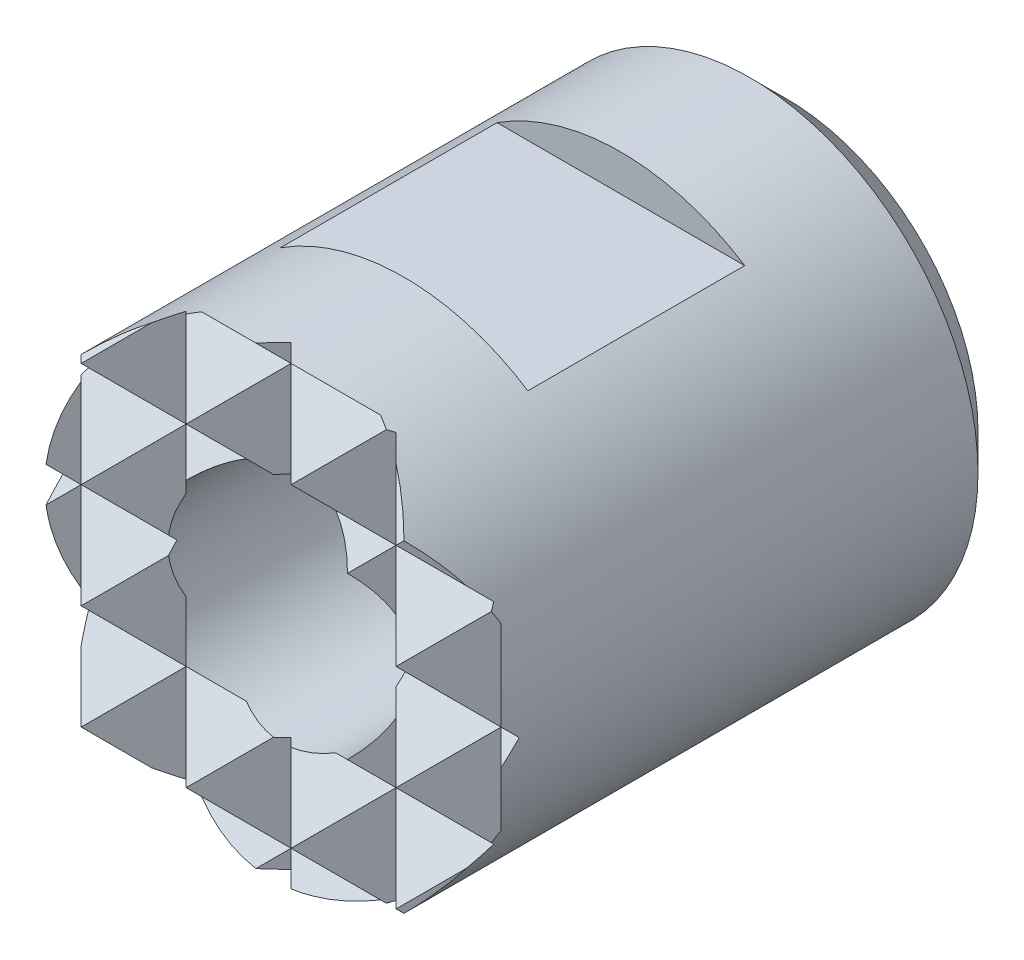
ISO-10303-21;
HEADER;
FILE_DESCRIPTION(('STEP AP214'),'2;1');
FILE_NAME('part.step','',(''),(''),'','','');
FILE_SCHEMA(('AUTOMOTIVE_DESIGN { 1 0 10303 214 1 1 1 1 }'));
ENDSEC;
DATA;
#1=APPLICATION_CONTEXT('core data for automotive mechanical design processes');
#2=APPLICATION_PROTOCOL_DEFINITION('international standard','automotive_design',2000,#1);
#3=PRODUCT_CONTEXT('',#1,'mechanical');
#4=PRODUCT('Part','Part','',(#3));
#5=PRODUCT_RELATED_PRODUCT_CATEGORY('part','',(#4));
#6=PRODUCT_DEFINITION_FORMATION('','',#4);
#7=PRODUCT_DEFINITION_CONTEXT('part definition',#1,'design');
#8=PRODUCT_DEFINITION('design','',#6,#7);
#9=PRODUCT_DEFINITION_SHAPE('','',#8);
#10=(LENGTH_UNIT() NAMED_UNIT(*) SI_UNIT(.MILLI.,.METRE.));
#11=(NAMED_UNIT(*) PLANE_ANGLE_UNIT() SI_UNIT($,.RADIAN.));
#12=(NAMED_UNIT(*) SI_UNIT($,.STERADIAN.) SOLID_ANGLE_UNIT());
#13=UNCERTAINTY_MEASURE_WITH_UNIT(LENGTH_MEASURE(1.E-05),#10,'distance_accuracy_value','');
#14=(GEOMETRIC_REPRESENTATION_CONTEXT(3) GLOBAL_UNCERTAINTY_ASSIGNED_CONTEXT((#13)) GLOBAL_UNIT_ASSIGNED_CONTEXT((#10,
#11,#12)) REPRESENTATION_CONTEXT('',''));
#15=CARTESIAN_POINT('',(0.,0.,0.));
#16=DIRECTION('',(0.,0.,1.));
#17=DIRECTION('',(1.,0.,0.));
#18=AXIS2_PLACEMENT_3D('',#15,#16,#17);
#19=CARTESIAN_POINT('',(3.45000000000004,-5.,12.));
#20=DIRECTION('',(-0.707106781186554,0.,-0.707106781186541));
#21=DIRECTION('',(-0.707106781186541,0.,0.707106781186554));
#22=AXIS2_PLACEMENT_3D('',#19,#20,#21);
#23=PLANE('',#22);
#24=CARTESIAN_POINT('',(0.,0.,15.45));
#25=DIRECTION('',(-0.707106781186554,0.,-0.707106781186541));
#26=DIRECTION('',(0.707106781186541,0.,-0.707106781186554));
#27=AXIS2_PLACEMENT_3D('',#24,#25,#26);
#28=ELLIPSE('',#27,7.07106781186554,5.);
#29=CARTESIAN_POINT('',(4.49327683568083,2.19327683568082,10.9567231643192));
#30=VERTEX_POINT('',#29);
#31=CARTESIAN_POINT('',(4.6,1.9595917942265,10.85));
#32=VERTEX_POINT('',#31);
#33=EDGE_CURVE('E514',#30,#32,#28,.T.);
#34=ORIENTED_EDGE('',*,*,#33,.F.);
#35=DIRECTION('',(-0.577350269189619,-0.577350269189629,0.577350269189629));
#36=VECTOR('',#35,1.);
#37=CARTESIAN_POINT('',(1.40000000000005,-0.900000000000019,14.05));
#38=LINE('',#37,#36);
#39=CARTESIAN_POINT('',(3.45000000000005,1.15,12.));
#40=VERTEX_POINT('',#39);
#41=EDGE_CURVE('E399',#30,#40,#38,.T.);
#42=ORIENTED_EDGE('',*,*,#41,.T.);
#43=DIRECTION('',(0.577350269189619,-0.577350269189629,-0.577350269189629));
#44=VECTOR('',#43,1.);
#45=CARTESIAN_POINT('',(5.5,-0.900000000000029,9.95));
#46=LINE('',#45,#44);
#47=CARTESIAN_POINT('',(4.6,0.,10.85));
#48=VERTEX_POINT('',#47);
#49=EDGE_CURVE('E375',#40,#48,#46,.T.);
#50=ORIENTED_EDGE('',*,*,#49,.T.);
#51=DIRECTION('',(0.,1.,0.));
#52=VECTOR('',#51,1.);
#53=CARTESIAN_POINT('',(4.6,-5.,10.85));
#54=LINE('',#53,#52);
#55=EDGE_CURVE('E432',#48,#32,#54,.T.);
#56=ORIENTED_EDGE('',*,*,#55,.T.);
#57=EDGE_LOOP('',(#34,#42,#50,#56));
#58=FACE_BOUND('',#57,.T.);
#59=ADVANCED_FACE('F14',(#58),#23,.F.);
#60=CARTESIAN_POINT('',(4.6,-1.9595917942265,10.85));
#61=VERTEX_POINT('',#60);
#62=EDGE_CURVE('E429',#61,#48,#54,.T.);
#63=ORIENTED_EDGE('',*,*,#62,.T.);
#64=DIRECTION('',(-0.577350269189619,-0.577350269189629,0.577350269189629));
#65=VECTOR('',#64,1.);
#66=CARTESIAN_POINT('',(2.16666666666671,-2.43333333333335,13.2833333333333));
#67=LINE('',#66,#65);
#68=CARTESIAN_POINT('',(3.45000000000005,-1.15,12.));
#69=VERTEX_POINT('',#68);
#70=EDGE_CURVE('E352',#48,#69,#67,.T.);
#71=ORIENTED_EDGE('',*,*,#70,.T.);
#72=DIRECTION('',(0.577350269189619,-0.577350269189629,-0.577350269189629));
#73=VECTOR('',#72,1.);
#74=CARTESIAN_POINT('',(4.73333333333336,-2.43333333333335,10.7166666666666));
#75=LINE('',#74,#73);
#76=CARTESIAN_POINT('',(4.49327683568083,-2.19327683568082,10.9567231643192));
#77=VERTEX_POINT('',#76);
#78=EDGE_CURVE('E633',#69,#77,#75,.T.);
#79=ORIENTED_EDGE('',*,*,#78,.T.);
#80=EDGE_CURVE('E519',#61,#77,#28,.T.);
#81=ORIENTED_EDGE('',*,*,#80,.F.);
#82=EDGE_LOOP('',(#63,#71,#79,#81));
#83=FACE_BOUND('',#82,.T.);
#84=ADVANCED_FACE('F801',(#83),#23,.F.);
#85=CARTESIAN_POINT('',(4.222981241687,-2.67701875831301,11.227018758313));
#86=VERTEX_POINT('',#85);
#87=CARTESIAN_POINT('',(3.53553390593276,-3.53553390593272,11.9144660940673));
#88=VERTEX_POINT('',#87);
#89=EDGE_CURVE('E516',#86,#88,#28,.T.);
#90=ORIENTED_EDGE('',*,*,#89,.F.);
#91=DIRECTION('',(-0.577350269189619,-0.577350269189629,0.577350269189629));
#92=VECTOR('',#91,1.);
#93=CARTESIAN_POINT('',(2.93333333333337,-3.96666666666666,12.5166666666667));
#94=LINE('',#93,#92);
#95=CARTESIAN_POINT('',(3.45000000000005,-3.45,12.));
#96=VERTEX_POINT('',#95);
#97=EDGE_CURVE('E611',#86,#96,#94,.T.);
#98=ORIENTED_EDGE('',*,*,#97,.T.);
#99=DIRECTION('',(0.577350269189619,-0.577350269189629,-0.577350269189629));
#100=VECTOR('',#99,1.);
#101=CARTESIAN_POINT('',(3.9666666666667,-3.96666666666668,11.4833333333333));
#102=LINE('',#101,#100);
#103=EDGE_CURVE('E864',#96,#88,#102,.T.);
#104=ORIENTED_EDGE('',*,*,#103,.T.);
#105=EDGE_LOOP('',(#90,#98,#104));
#106=FACE_BOUND('',#105,.T.);
#107=ADVANCED_FACE('F946',(#106),#23,.F.);
#108=CARTESIAN_POINT('',(4.6,-5.,10.85));
#109=DIRECTION('',(0.707106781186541,0.,-0.707106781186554));
#110=DIRECTION('',(-0.707106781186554,0.,-0.707106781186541));
#111=AXIS2_PLACEMENT_3D('',#108,#109,#110);
#112=PLANE('',#111);
#113=ORIENTED_EDGE('',*,*,#55,.F.);
#114=DIRECTION('',(0.577350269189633,0.577350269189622,0.577350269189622));
#115=VECTOR('',#114,1.);
#116=CARTESIAN_POINT('',(2.93333333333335,-1.66666666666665,9.18333333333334));
#117=LINE('',#116,#115);
#118=CARTESIAN_POINT('',(4.98514431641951,0.385144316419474,11.2351443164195));
#119=VERTEX_POINT('',#118);
#120=EDGE_CURVE('E377',#48,#119,#117,.T.);
#121=ORIENTED_EDGE('',*,*,#120,.T.);
#122=CARTESIAN_POINT('',(0.,0.,6.25));
#123=DIRECTION('',(0.707106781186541,0.,-0.707106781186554));
#124=DIRECTION('',(-0.707106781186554,0.,-0.707106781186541));
#125=AXIS2_PLACEMENT_3D('',#122,#123,#124);
#126=ELLIPSE('',#125,7.07106781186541,5.);
#127=EDGE_CURVE('E520',#32,#119,#126,.T.);
#128=ORIENTED_EDGE('',*,*,#127,.F.);
#129=EDGE_LOOP('',(#113,#121,#128));
#130=FACE_BOUND('',#129,.T.);
#131=ADVANCED_FACE('F958',(#130),#112,.F.);
#132=CARTESIAN_POINT('',(-5.75,-5.,12.));
#133=DIRECTION('',(-0.70710678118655,0.,-0.707106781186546));
#134=DIRECTION('',(-0.707106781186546,0.,0.70710678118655));
#135=AXIS2_PLACEMENT_3D('',#132,#133,#134);
#136=PLANE('',#135);
#137=CARTESIAN_POINT('',(0.,0.,6.25));
#138=DIRECTION('',(-0.70710678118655,0.,-0.707106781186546));
#139=DIRECTION('',(0.707106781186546,0.,-0.70710678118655));
#140=AXIS2_PLACEMENT_3D('',#137,#138,#139);
#141=ELLIPSE('',#140,7.0710678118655,5.);
#142=CARTESIAN_POINT('',(-4.98514431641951,0.385144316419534,11.2351443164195));
#143=VERTEX_POINT('',#142);
#144=CARTESIAN_POINT('',(-4.6,1.95959179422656,10.85));
#145=VERTEX_POINT('',#144);
#146=EDGE_CURVE('E530',#143,#145,#141,.T.);
#147=ORIENTED_EDGE('',*,*,#146,.F.);
#148=DIRECTION('',(0.577350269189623,-0.577350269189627,-0.577350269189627));
#149=VECTOR('',#148,1.);
#150=CARTESIAN_POINT('',(-3.7,-0.899999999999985,9.95));
#151=LINE('',#150,#149);
#152=CARTESIAN_POINT('',(-4.6,0.,10.85));
#153=VERTEX_POINT('',#152);
#154=EDGE_CURVE('E325',#143,#153,#151,.T.);
#155=ORIENTED_EDGE('',*,*,#154,.T.);
#156=DIRECTION('',(0.,1.,0.));
#157=VECTOR('',#156,1.);
#158=CARTESIAN_POINT('',(-4.6,-5.,10.85));
#159=LINE('',#158,#157);
#160=EDGE_CURVE('E436',#153,#145,#159,.T.);
#161=ORIENTED_EDGE('',*,*,#160,.T.);
#162=EDGE_LOOP('',(#147,#155,#161));
#163=FACE_BOUND('',#162,.T.);
#164=ADVANCED_FACE('F661',(#163),#136,.F.);
#165=CARTESIAN_POINT('',(-4.6,-5.,10.85));
#166=DIRECTION('',(0.707106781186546,0.,-0.70710678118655));
#167=DIRECTION('',(-0.70710678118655,0.,-0.707106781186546));
#168=AXIS2_PLACEMENT_3D('',#165,#166,#167);
#169=PLANE('',#168);
#170=DIRECTION('',(0.577350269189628,0.577350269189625,0.577350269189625));
#171=VECTOR('',#170,1.);
#172=CARTESIAN_POINT('',(-6.26666666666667,-1.66666666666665,9.18333333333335));
#173=LINE('',#172,#171);
#174=CARTESIAN_POINT('',(-3.45,1.15,12.));
#175=VERTEX_POINT('',#174);
#176=EDGE_CURVE('E357',#153,#175,#173,.T.);
#177=ORIENTED_EDGE('',*,*,#176,.T.);
#178=DIRECTION('',(-0.577350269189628,0.577350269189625,-0.577350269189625));
#179=VECTOR('',#178,1.);
#180=CARTESIAN_POINT('',(-2.16666666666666,-0.133333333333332,13.2833333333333));
#181=LINE('',#180,#179);
#182=CARTESIAN_POINT('',(-4.49327683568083,2.19327683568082,10.9567231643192));
#183=VERTEX_POINT('',#182);
#184=EDGE_CURVE('E383',#175,#183,#181,.T.);
#185=ORIENTED_EDGE('',*,*,#184,.T.);
#186=CARTESIAN_POINT('',(0.,0.,15.45));
#187=DIRECTION('',(0.707106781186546,0.,-0.70710678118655));
#188=DIRECTION('',(-0.70710678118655,0.,-0.707106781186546));
#189=AXIS2_PLACEMENT_3D('',#186,#187,#188);
#190=ELLIPSE('',#189,7.07106781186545,5.);
#191=EDGE_CURVE('E527',#145,#183,#190,.T.);
#192=ORIENTED_EDGE('',*,*,#191,.F.);
#193=ORIENTED_EDGE('',*,*,#160,.F.);
#194=EDGE_LOOP('',(#177,#185,#192,#193));
#195=FACE_BOUND('',#194,.T.);
#196=ADVANCED_FACE('F658',(#195),#169,.F.);
#197=DIRECTION('',(0.577350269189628,0.577350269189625,0.577350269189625));
#198=VECTOR('',#197,1.);
#199=CARTESIAN_POINT('',(-5.5,-3.2,9.95));
#200=LINE('',#199,#198);
#201=CARTESIAN_POINT('',(-4.49327683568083,-2.19327683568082,10.9567231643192));
#202=VERTEX_POINT('',#201);
#203=CARTESIAN_POINT('',(-3.45,-1.15,12.));
#204=VERTEX_POINT('',#203);
#205=EDGE_CURVE('E617',#202,#204,#200,.T.);
#206=ORIENTED_EDGE('',*,*,#205,.T.);
#207=DIRECTION('',(-0.577350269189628,0.577350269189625,-0.577350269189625));
#208=VECTOR('',#207,1.);
#209=CARTESIAN_POINT('',(-2.93333333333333,-1.66666666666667,12.5166666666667));
#210=LINE('',#209,#208);
#211=EDGE_CURVE('E636',#204,#153,#210,.T.);
#212=ORIENTED_EDGE('',*,*,#211,.T.);
#213=CARTESIAN_POINT('',(-4.6,-1.95959179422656,10.85));
#214=VERTEX_POINT('',#213);
#215=EDGE_CURVE('E433',#214,#153,#159,.T.);
#216=ORIENTED_EDGE('',*,*,#215,.F.);
#217=EDGE_CURVE('E528',#202,#214,#190,.T.);
#218=ORIENTED_EDGE('',*,*,#217,.F.);
#219=EDGE_LOOP('',(#206,#212,#216,#218));
#220=FACE_BOUND('',#219,.T.);
#221=ADVANCED_FACE('F644',(#220),#169,.F.);
#222=DIRECTION('',(0.577350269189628,0.577350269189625,0.577350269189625));
#223=VECTOR('',#222,1.);
#224=CARTESIAN_POINT('',(-4.73333333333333,-4.73333333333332,10.7166666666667));
#225=LINE('',#224,#223);
#226=CARTESIAN_POINT('',(-3.53553390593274,-3.53553390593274,11.9144660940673));
#227=VERTEX_POINT('',#226);
#228=CARTESIAN_POINT('',(-3.45,-3.45,12.));
#229=VERTEX_POINT('',#228);
#230=EDGE_CURVE('E857',#227,#229,#225,.T.);
#231=ORIENTED_EDGE('',*,*,#230,.T.);
#232=DIRECTION('',(-0.577350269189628,0.577350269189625,-0.577350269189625));
#233=VECTOR('',#232,1.);
#234=CARTESIAN_POINT('',(-3.7,-3.2,11.75));
#235=LINE('',#234,#233);
#236=CARTESIAN_POINT('',(-4.222981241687,-2.677018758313,11.227018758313));
#237=VERTEX_POINT('',#236);
#238=EDGE_CURVE('E591',#229,#237,#235,.T.);
#239=ORIENTED_EDGE('',*,*,#238,.T.);
#240=EDGE_CURVE('E662',#227,#237,#190,.T.);
#241=ORIENTED_EDGE('',*,*,#240,.F.);
#242=EDGE_LOOP('',(#231,#239,#241));
#243=FACE_BOUND('',#242,.T.);
#244=ADVANCED_FACE('F1097',(#243),#169,.F.);
#245=CARTESIAN_POINT('',(-2.30000000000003,-5.,10.85));
#246=DIRECTION('',(0.707106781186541,0.,-0.707106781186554));
#247=DIRECTION('',(-0.707106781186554,0.,-0.707106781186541));
#248=AXIS2_PLACEMENT_3D('',#245,#246,#247);
#249=PLANE('',#248);
#250=CARTESIAN_POINT('',(0.,0.,13.15));
#251=DIRECTION('',(0.707106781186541,0.,-0.707106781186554));
#252=DIRECTION('',(0.707106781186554,0.,0.707106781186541));
#253=AXIS2_PLACEMENT_3D('',#250,#251,#252);
#254=ELLIPSE('',#253,3.5355339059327,2.5);
#255=CARTESIAN_POINT('',(-2.30000000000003,0.979795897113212,10.85));
#256=VERTEX_POINT('',#255);
#257=CARTESIAN_POINT('',(-1.76776695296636,1.76776695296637,11.3822330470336));
#258=VERTEX_POINT('',#257);
#259=EDGE_CURVE('E495',#256,#258,#254,.T.);
#260=ORIENTED_EDGE('',*,*,#259,.T.);
#261=DIRECTION('',(-0.577350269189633,0.577350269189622,-0.577350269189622));
#262=VECTOR('',#261,1.);
#263=CARTESIAN_POINT('',(0.133333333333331,-0.13333333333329,13.2833333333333));
#264=LINE('',#263,#262);
#265=CARTESIAN_POINT('',(-2.30000000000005,2.3,10.85));
#266=VERTEX_POINT('',#265);
#267=EDGE_CURVE('E380',#258,#266,#264,.T.);
#268=ORIENTED_EDGE('',*,*,#267,.T.);
#269=DIRECTION('',(0.,1.,0.));
#270=VECTOR('',#269,1.);
#271=CARTESIAN_POINT('',(-2.30000000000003,-5.,10.85));
#272=LINE('',#271,#270);
#273=EDGE_CURVE('E437',#256,#266,#272,.T.);
#274=ORIENTED_EDGE('',*,*,#273,.F.);
#275=EDGE_LOOP('',(#260,#268,#274));
#276=FACE_BOUND('',#275,.T.);
#277=ADVANCED_FACE('F920',(#276),#249,.F.);
#278=CARTESIAN_POINT('',(-2.30000000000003,-2.3,10.85));
#279=VERTEX_POINT('',#278);
#280=CARTESIAN_POINT('',(-2.30000000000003,-0.979795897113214,10.85));
#281=VERTEX_POINT('',#280);
#282=EDGE_CURVE('E440',#279,#281,#272,.T.);
#283=ORIENTED_EDGE('',*,*,#282,.F.);
#284=DIRECTION('',(0.577350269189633,0.577350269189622,0.577350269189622));
#285=VECTOR('',#284,1.);
#286=CARTESIAN_POINT('',(-3.2,-3.2,9.95));
#287=LINE('',#286,#285);
#288=CARTESIAN_POINT('',(-1.76776695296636,-1.76776695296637,11.3822330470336));
#289=VERTEX_POINT('',#288);
#290=EDGE_CURVE('E614',#279,#289,#287,.T.);
#291=ORIENTED_EDGE('',*,*,#290,.T.);
#292=EDGE_CURVE('E498',#289,#281,#254,.T.);
#293=ORIENTED_EDGE('',*,*,#292,.T.);
#294=EDGE_LOOP('',(#283,#291,#293));
#295=FACE_BOUND('',#294,.T.);
#296=ADVANCED_FACE('F1082',(#295),#249,.F.);
#297=CARTESIAN_POINT('',(-1.14999999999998,-5.,12.));
#298=DIRECTION('',(-0.707106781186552,0.,-0.707106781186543));
#299=DIRECTION('',(-0.707106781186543,0.,0.707106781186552));
#300=AXIS2_PLACEMENT_3D('',#297,#298,#299);
#301=PLANE('',#300);
#302=CARTESIAN_POINT('',(0.,0.,10.85));
#303=DIRECTION('',(-0.707106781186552,0.,-0.707106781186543));
#304=DIRECTION('',(0.707106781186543,0.,-0.707106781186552));
#305=AXIS2_PLACEMENT_3D('',#302,#303,#304);
#306=ELLIPSE('',#305,7.07106781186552,5.);
#307=CARTESIAN_POINT('',(-0.385144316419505,4.98514431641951,11.2351443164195));
#308=VERTEX_POINT('',#307);
#309=CARTESIAN_POINT('',(0.,5.,10.85));
#310=VERTEX_POINT('',#309);
#311=EDGE_CURVE('E458',#308,#310,#306,.T.);
#312=ORIENTED_EDGE('',*,*,#311,.F.);
#313=DIRECTION('',(0.577350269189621,-0.577350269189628,-0.577350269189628));
#314=VECTOR('',#313,1.);
#315=CARTESIAN_POINT('',(2.43333333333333,2.16666666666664,8.41666666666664));
#316=LINE('',#315,#314);
#317=CARTESIAN_POINT('',(0.,4.6,10.85));
#318=VERTEX_POINT('',#317);
#319=EDGE_CURVE('E409',#308,#318,#316,.T.);
#320=ORIENTED_EDGE('',*,*,#319,.T.);
#321=DIRECTION('',(0.,1.,0.));
#322=VECTOR('',#321,1.);
#323=CARTESIAN_POINT('',(0.,-5.,10.85));
#324=LINE('',#323,#322);
#325=EDGE_CURVE('E421',#318,#310,#324,.T.);
#326=ORIENTED_EDGE('',*,*,#325,.T.);
#327=EDGE_LOOP('',(#312,#320,#326));
#328=FACE_BOUND('',#327,.T.);
#329=ADVANCED_FACE('F842',(#328),#301,.F.);
#330=CARTESIAN_POINT('',(0.,0.,10.85));
#331=DIRECTION('',(-0.707106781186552,0.,-0.707106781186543));
#332=DIRECTION('',(-0.707106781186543,0.,0.707106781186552));
#333=AXIS2_PLACEMENT_3D('',#330,#331,#332);
#334=ELLIPSE('',#333,3.53553390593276,2.5);
#335=CARTESIAN_POINT('',(0.,-2.5,10.85));
#336=VERTEX_POINT('',#335);
#337=CARTESIAN_POINT('',(-0.192572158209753,-2.49257215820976,11.0425721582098));
#338=VERTEX_POINT('',#337);
#339=EDGE_CURVE('E499',#336,#338,#334,.T.);
#340=ORIENTED_EDGE('',*,*,#339,.T.);
#341=DIRECTION('',(-0.577350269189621,-0.577350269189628,0.577350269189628));
#342=VECTOR('',#341,1.);
#343=CARTESIAN_POINT('',(-1.66666666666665,-3.96666666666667,12.5166666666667));
#344=LINE('',#343,#342);
#345=CARTESIAN_POINT('',(-1.14999999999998,-3.45,12.));
#346=VERTEX_POINT('',#345);
#347=EDGE_CURVE('E578',#338,#346,#344,.T.);
#348=ORIENTED_EDGE('',*,*,#347,.T.);
#349=DIRECTION('',(0.577350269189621,-0.577350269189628,-0.577350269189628));
#350=VECTOR('',#349,1.);
#351=CARTESIAN_POINT('',(-0.63333333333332,-3.96666666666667,11.4833333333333));
#352=LINE('',#351,#350);
#353=CARTESIAN_POINT('',(0.,-4.6,10.85));
#354=VERTEX_POINT('',#353);
#355=EDGE_CURVE('E37',#346,#354,#352,.T.);
#356=ORIENTED_EDGE('',*,*,#355,.T.);
#357=EDGE_CURVE('E420',#354,#336,#324,.T.);
#358=ORIENTED_EDGE('',*,*,#357,.T.);
#359=EDGE_LOOP('',(#340,#348,#356,#358));
#360=FACE_BOUND('',#359,.T.);
#361=ADVANCED_FACE('F577',(#360),#301,.F.);
#362=CARTESIAN_POINT('',(0.,-5.,10.85));
#363=DIRECTION('',(0.707106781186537,0.,-0.707106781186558));
#364=DIRECTION('',(-0.707106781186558,0.,-0.707106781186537));
#365=AXIS2_PLACEMENT_3D('',#362,#363,#364);
#366=PLANE('',#365);
#367=ORIENTED_EDGE('',*,*,#325,.F.);
#368=DIRECTION('',(0.577350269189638,0.57735026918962,0.57735026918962));
#369=VECTOR('',#368,1.);
#370=CARTESIAN_POINT('',(-3.2,1.40000000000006,7.65));
#371=LINE('',#370,#369);
#372=CARTESIAN_POINT('',(0.385144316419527,4.98514431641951,11.2351443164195));
#373=VERTEX_POINT('',#372);
#374=EDGE_CURVE('E9',#318,#373,#371,.T.);
#375=ORIENTED_EDGE('',*,*,#374,.T.);
#376=CARTESIAN_POINT('',(0.,0.,10.85));
#377=DIRECTION('',(0.707106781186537,0.,-0.707106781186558));
#378=DIRECTION('',(-0.707106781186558,0.,-0.707106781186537));
#379=AXIS2_PLACEMENT_3D('',#376,#377,#378);
#380=ELLIPSE('',#379,7.07106781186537,5.);
#381=EDGE_CURVE('E454',#310,#373,#380,.T.);
#382=ORIENTED_EDGE('',*,*,#381,.F.);
#383=EDGE_LOOP('',(#367,#375,#382));
#384=FACE_BOUND('',#383,.T.);
#385=ADVANCED_FACE('F843',(#384),#366,.F.);
#386=DIRECTION('',(0.577350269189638,0.57735026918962,0.57735026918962));
#387=VECTOR('',#386,1.);
#388=CARTESIAN_POINT('',(-0.133333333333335,-4.73333333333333,10.7166666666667));
#389=LINE('',#388,#387);
#390=CARTESIAN_POINT('',(1.14999999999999,-3.45,12.));
#391=VERTEX_POINT('',#390);
#392=EDGE_CURVE('E572',#354,#391,#389,.T.);
#393=ORIENTED_EDGE('',*,*,#392,.T.);
#394=DIRECTION('',(-0.577350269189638,0.57735026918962,-0.57735026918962));
#395=VECTOR('',#394,1.);
#396=CARTESIAN_POINT('',(0.9,-3.2,11.75));
#397=LINE('',#396,#395);
#398=CARTESIAN_POINT('',(0.19257215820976,-2.49257215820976,11.0425721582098));
#399=VERTEX_POINT('',#398);
#400=EDGE_CURVE('E609',#391,#399,#397,.T.);
#401=ORIENTED_EDGE('',*,*,#400,.T.);
#402=CARTESIAN_POINT('',(0.,0.,10.85));
#403=DIRECTION('',(0.707106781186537,0.,-0.707106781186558));
#404=DIRECTION('',(0.707106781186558,0.,0.707106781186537));
#405=AXIS2_PLACEMENT_3D('',#402,#403,#404);
#406=ELLIPSE('',#405,3.53553390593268,2.5);
#407=EDGE_CURVE('E506',#399,#336,#406,.T.);
#408=ORIENTED_EDGE('',*,*,#407,.T.);
#409=ORIENTED_EDGE('',*,*,#357,.F.);
#410=EDGE_LOOP('',(#393,#401,#408,#409));
#411=FACE_BOUND('',#410,.T.);
#412=ADVANCED_FACE('F569',(#411),#366,.F.);
#413=CARTESIAN_POINT('',(1.15000000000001,-5.,12.));
#414=DIRECTION('',(-0.707106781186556,0.,-0.707106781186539));
#415=DIRECTION('',(-0.707106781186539,0.,0.707106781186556));
#416=AXIS2_PLACEMENT_3D('',#413,#414,#415);
#417=PLANE('',#416);
#418=CARTESIAN_POINT('',(0.,0.,13.15));
#419=DIRECTION('',(-0.707106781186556,0.,-0.707106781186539));
#420=DIRECTION('',(-0.707106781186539,0.,0.707106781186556));
#421=AXIS2_PLACEMENT_3D('',#418,#419,#420);
#422=ELLIPSE('',#421,3.53553390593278,2.5);
#423=CARTESIAN_POINT('',(2.3,-0.97979589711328,10.85));
#424=VERTEX_POINT('',#423);
#425=CARTESIAN_POINT('',(1.76776695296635,-1.76776695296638,11.3822330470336));
#426=VERTEX_POINT('',#425);
#427=EDGE_CURVE('E507',#424,#426,#422,.T.);
#428=ORIENTED_EDGE('',*,*,#427,.T.);
#429=DIRECTION('',(0.577350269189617,-0.577350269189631,-0.577350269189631));
#430=VECTOR('',#429,1.);
#431=CARTESIAN_POINT('',(2.43333333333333,-2.43333333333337,10.7166666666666));
#432=LINE('',#431,#430);
#433=CARTESIAN_POINT('',(2.30000000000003,-2.3,10.85));
#434=VERTEX_POINT('',#433);
#435=EDGE_CURVE('E630',#426,#434,#432,.T.);
#436=ORIENTED_EDGE('',*,*,#435,.T.);
#437=DIRECTION('',(0.,1.,0.));
#438=VECTOR('',#437,1.);
#439=CARTESIAN_POINT('',(2.3,-5.,10.85));
#440=LINE('',#439,#438);
#441=EDGE_CURVE('E426',#434,#424,#440,.T.);
#442=ORIENTED_EDGE('',*,*,#441,.T.);
#443=EDGE_LOOP('',(#428,#436,#442));
#444=FACE_BOUND('',#443,.T.);
#445=ADVANCED_FACE('F795',(#444),#417,.F.);
#446=CARTESIAN_POINT('',(2.3,0.979795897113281,10.85));
#447=VERTEX_POINT('',#446);
#448=CARTESIAN_POINT('',(2.30000000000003,2.3,10.85));
#449=VERTEX_POINT('',#448);
#450=EDGE_CURVE('E423',#447,#449,#440,.T.);
#451=ORIENTED_EDGE('',*,*,#450,.T.);
#452=DIRECTION('',(-0.577350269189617,-0.577350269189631,0.577350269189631));
#453=VECTOR('',#452,1.);
#454=CARTESIAN_POINT('',(-0.899999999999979,-0.900000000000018,14.05));
#455=LINE('',#454,#453);
#456=CARTESIAN_POINT('',(1.76776695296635,1.76776695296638,11.3822330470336));
#457=VERTEX_POINT('',#456);
#458=EDGE_CURVE('E396',#449,#457,#455,.T.);
#459=ORIENTED_EDGE('',*,*,#458,.T.);
#460=EDGE_CURVE('E510',#457,#447,#422,.T.);
#461=ORIENTED_EDGE('',*,*,#460,.T.);
#462=EDGE_LOOP('',(#451,#459,#461));
#463=FACE_BOUND('',#462,.T.);
#464=ADVANCED_FACE('F736',(#463),#417,.F.);
#465=CARTESIAN_POINT('',(2.3,-5.,10.85));
#466=DIRECTION('',(0.707106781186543,0.,-0.707106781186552));
#467=DIRECTION('',(-0.707106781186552,0.,-0.707106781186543));
#468=AXIS2_PLACEMENT_3D('',#465,#466,#467);
#469=PLANE('',#468);
#470=DIRECTION('',(0.57735026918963,0.577350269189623,0.577350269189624));
#471=VECTOR('',#470,1.);
#472=CARTESIAN_POINT('',(1.4,-3.2,9.95));
#473=LINE('',#472,#471);
#474=EDGE_CURVE('E626',#434,#69,#473,.T.);
#475=ORIENTED_EDGE('',*,*,#474,.T.);
#476=DIRECTION('',(-0.57735026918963,0.577350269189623,-0.577350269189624));
#477=VECTOR('',#476,1.);
#478=CARTESIAN_POINT('',(3.96666666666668,-1.66666666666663,12.5166666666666));
#479=LINE('',#478,#477);
#480=CARTESIAN_POINT('',(2.49257215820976,-0.192572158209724,11.0425721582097));
#481=VERTEX_POINT('',#480);
#482=EDGE_CURVE('E347',#69,#481,#479,.T.);
#483=ORIENTED_EDGE('',*,*,#482,.T.);
#484=CARTESIAN_POINT('',(0.,0.,8.55));
#485=DIRECTION('',(0.707106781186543,0.,-0.707106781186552));
#486=DIRECTION('',(0.707106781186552,0.,0.707106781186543));
#487=AXIS2_PLACEMENT_3D('',#484,#485,#486);
#488=ELLIPSE('',#487,3.53553390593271,2.5);
#489=EDGE_CURVE('E515',#481,#424,#488,.T.);
#490=ORIENTED_EDGE('',*,*,#489,.T.);
#491=ORIENTED_EDGE('',*,*,#441,.F.);
#492=EDGE_LOOP('',(#475,#483,#490,#491));
#493=FACE_BOUND('',#492,.T.);
#494=ADVANCED_FACE('F757',(#493),#469,.F.);
#495=DIRECTION('',(0.57735026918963,0.577350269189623,0.577350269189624));
#496=VECTOR('',#495,1.);
#497=CARTESIAN_POINT('',(2.16666666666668,-4.73333333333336,10.7166666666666));
#498=LINE('',#497,#496);
#499=CARTESIAN_POINT('',(2.67701875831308,-4.22298124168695,11.227018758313));
#500=VERTEX_POINT('',#499);
#501=EDGE_CURVE('E788',#500,#96,#498,.T.);
#502=ORIENTED_EDGE('',*,*,#501,.T.);
#503=DIRECTION('',(-0.57735026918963,0.577350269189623,-0.577350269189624));
#504=VECTOR('',#503,1.);
#505=CARTESIAN_POINT('',(3.2,-3.2,11.75));
#506=LINE('',#505,#504);
#507=EDGE_CURVE('E602',#96,#434,#506,.T.);
#508=ORIENTED_EDGE('',*,*,#507,.T.);
#509=CARTESIAN_POINT('',(2.3,-4.43959457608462,10.85));
#510=VERTEX_POINT('',#509);
#511=EDGE_CURVE('E428',#510,#434,#440,.T.);
#512=ORIENTED_EDGE('',*,*,#511,.F.);
#513=CARTESIAN_POINT('',(0.,0.,8.55));
#514=DIRECTION('',(0.707106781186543,0.,-0.707106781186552));
#515=DIRECTION('',(-0.707106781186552,0.,-0.707106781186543));
#516=AXIS2_PLACEMENT_3D('',#513,#514,#515);
#517=ELLIPSE('',#516,7.07106781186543,5.);
#518=EDGE_CURVE('E446',#500,#510,#517,.T.);
#519=ORIENTED_EDGE('',*,*,#518,.F.);
#520=EDGE_LOOP('',(#502,#508,#512,#519));
#521=FACE_BOUND('',#520,.T.);
#522=ADVANCED_FACE('F786',(#521),#469,.F.);
#523=CARTESIAN_POINT('',(2.49257215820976,0.192572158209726,11.0425721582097));
#524=VERTEX_POINT('',#523);
#525=EDGE_CURVE('E511',#447,#524,#488,.T.);
#526=ORIENTED_EDGE('',*,*,#525,.T.);
#527=DIRECTION('',(0.57735026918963,0.577350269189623,0.577350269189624));
#528=VECTOR('',#527,1.);
#529=CARTESIAN_POINT('',(0.633333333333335,-1.66666666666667,9.18333333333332));
#530=LINE('',#529,#528);
#531=EDGE_CURVE('E329',#524,#40,#530,.T.);
#532=ORIENTED_EDGE('',*,*,#531,.T.);
#533=DIRECTION('',(-0.57735026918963,0.577350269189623,-0.577350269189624));
#534=VECTOR('',#533,1.);
#535=CARTESIAN_POINT('',(4.73333333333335,-0.133333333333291,13.2833333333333));
#536=LINE('',#535,#534);
#537=EDGE_CURVE('E392',#40,#449,#536,.T.);
#538=ORIENTED_EDGE('',*,*,#537,.T.);
#539=ORIENTED_EDGE('',*,*,#450,.F.);
#540=EDGE_LOOP('',(#526,#532,#538,#539));
#541=FACE_BOUND('',#540,.T.);
#542=ADVANCED_FACE('F739',(#541),#469,.F.);
#543=CARTESIAN_POINT('',(-3.45,-5.,12.));
#544=DIRECTION('',(-0.707106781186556,0.,-0.707106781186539));
#545=DIRECTION('',(-0.707106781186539,0.,0.707106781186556));
#546=AXIS2_PLACEMENT_3D('',#543,#544,#545);
#547=PLANE('',#546);
#548=CARTESIAN_POINT('',(0.,0.,8.5499999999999));
#549=DIRECTION('',(-0.707106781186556,0.,-0.707106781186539));
#550=DIRECTION('',(-0.707106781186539,0.,0.707106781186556));
#551=AXIS2_PLACEMENT_3D('',#548,#549,#550);
#552=ELLIPSE('',#551,3.53553390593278,2.5);
#553=CARTESIAN_POINT('',(-2.49257215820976,-0.192572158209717,11.0425721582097));
#554=VERTEX_POINT('',#553);
#555=EDGE_CURVE('E492',#281,#554,#552,.T.);
#556=ORIENTED_EDGE('',*,*,#555,.T.);
#557=DIRECTION('',(-0.577350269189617,-0.577350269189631,0.577350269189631));
#558=VECTOR('',#557,1.);
#559=CARTESIAN_POINT('',(-4.73333333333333,-2.43333333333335,13.2833333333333));
#560=LINE('',#559,#558);
#561=EDGE_CURVE('E552',#554,#204,#560,.T.);
#562=ORIENTED_EDGE('',*,*,#561,.T.);
#563=DIRECTION('',(0.577350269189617,-0.577350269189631,-0.577350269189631));
#564=VECTOR('',#563,1.);
#565=CARTESIAN_POINT('',(-2.16666666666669,-2.43333333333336,10.7166666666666));
#566=LINE('',#565,#564);
#567=EDGE_CURVE('E549',#204,#279,#566,.T.);
#568=ORIENTED_EDGE('',*,*,#567,.T.);
#569=ORIENTED_EDGE('',*,*,#282,.T.);
#570=EDGE_LOOP('',(#556,#562,#568,#569));
#571=FACE_BOUND('',#570,.T.);
#572=ADVANCED_FACE('F1028',(#571),#547,.F.);
#573=CARTESIAN_POINT('',(-2.30000000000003,-4.43959457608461,10.85));
#574=VERTEX_POINT('',#573);
#575=EDGE_CURVE('E442',#574,#279,#272,.T.);
#576=ORIENTED_EDGE('',*,*,#575,.T.);
#577=DIRECTION('',(-0.577350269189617,-0.577350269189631,0.577350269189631));
#578=VECTOR('',#577,1.);
#579=CARTESIAN_POINT('',(-3.96666666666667,-3.96666666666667,12.5166666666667));
#580=LINE('',#579,#578);
#581=EDGE_CURVE('E546',#279,#229,#580,.T.);
#582=ORIENTED_EDGE('',*,*,#581,.T.);
#583=DIRECTION('',(0.577350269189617,-0.577350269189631,-0.577350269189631));
#584=VECTOR('',#583,1.);
#585=CARTESIAN_POINT('',(-2.93333333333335,-3.96666666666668,11.4833333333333));
#586=LINE('',#585,#584);
#587=CARTESIAN_POINT('',(-2.67701875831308,-4.22298124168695,11.227018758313));
#588=VERTEX_POINT('',#587);
#589=EDGE_CURVE('E543',#229,#588,#586,.T.);
#590=ORIENTED_EDGE('',*,*,#589,.T.);
#591=CARTESIAN_POINT('',(0.,0.,8.5499999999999));
#592=DIRECTION('',(-0.707106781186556,0.,-0.707106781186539));
#593=DIRECTION('',(0.707106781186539,0.,-0.707106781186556));
#594=AXIS2_PLACEMENT_3D('',#591,#592,#593);
#595=ELLIPSE('',#594,7.07106781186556,5.);
#596=EDGE_CURVE('E419',#574,#588,#595,.T.);
#597=ORIENTED_EDGE('',*,*,#596,.F.);
#598=EDGE_LOOP('',(#576,#582,#590,#597));
#599=FACE_BOUND('',#598,.T.);
#600=ADVANCED_FACE('F1035',(#599),#547,.F.);
#601=DIRECTION('',(-0.577350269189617,-0.577350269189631,0.577350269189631));
#602=VECTOR('',#601,1.);
#603=CARTESIAN_POINT('',(-5.5,-0.900000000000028,14.05));
#604=LINE('',#603,#602);
#605=EDGE_CURVE('E537',#266,#175,#604,.T.);
#606=ORIENTED_EDGE('',*,*,#605,.T.);
#607=DIRECTION('',(0.577350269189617,-0.577350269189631,-0.577350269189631));
#608=VECTOR('',#607,1.);
#609=CARTESIAN_POINT('',(-1.40000000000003,-0.900000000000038,9.95));
#610=LINE('',#609,#608);
#611=CARTESIAN_POINT('',(-2.49257215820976,0.192572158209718,11.0425721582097));
#612=VERTEX_POINT('',#611);
#613=EDGE_CURVE('E540',#175,#612,#610,.T.);
#614=ORIENTED_EDGE('',*,*,#613,.T.);
#615=EDGE_CURVE('E491',#612,#256,#552,.T.);
#616=ORIENTED_EDGE('',*,*,#615,.T.);
#617=ORIENTED_EDGE('',*,*,#273,.T.);
#618=EDGE_LOOP('',(#606,#614,#616,#617));
#619=FACE_BOUND('',#618,.T.);
#620=ADVANCED_FACE('F922',(#619),#547,.F.);
#621=CARTESIAN_POINT('',(0.,0.,12.));
#622=DIRECTION('',(0.,0.,-1.));
#623=DIRECTION('',(-1.,0.,0.));
#624=AXIS2_PLACEMENT_3D('',#621,#622,#623);
#625=CYLINDRICAL_SURFACE('',#624,5.);
#626=CARTESIAN_POINT('',(0.,0.,8.375));
#627=DIRECTION('',(0.,0.,1.));
#628=DIRECTION('',(1.,0.,0.));
#629=AXIS2_PLACEMENT_3D('',#626,#627,#628);
#630=CIRCLE('',#629,5.);
#631=CARTESIAN_POINT('',(2.71293199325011,4.2,8.375));
#632=VERTEX_POINT('',#631);
#633=CARTESIAN_POINT('',(-2.71293199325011,4.2,8.375));
#634=VERTEX_POINT('',#633);
#635=EDGE_CURVE('E485',#632,#634,#630,.T.);
#636=ORIENTED_EDGE('',*,*,#635,.T.);
#637=DIRECTION('',(0.,0.,-1.));
#638=VECTOR('',#637,1.);
#639=CARTESIAN_POINT('',(-2.71293199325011,4.2,12.));
#640=LINE('',#639,#638);
#641=CARTESIAN_POINT('',(-2.71293199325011,4.2,3.625));
#642=VERTEX_POINT('',#641);
#643=EDGE_CURVE('E488',#634,#642,#640,.T.);
#644=ORIENTED_EDGE('',*,*,#643,.T.);
#645=CARTESIAN_POINT('',(0.,0.,3.625));
#646=DIRECTION('',(0.,0.,-1.));
#647=DIRECTION('',(0.,1.,0.));
#648=AXIS2_PLACEMENT_3D('',#645,#646,#647);
#649=CIRCLE('',#648,5.);
#650=CARTESIAN_POINT('',(2.71293199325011,4.2,3.625));
#651=VERTEX_POINT('',#650);
#652=EDGE_CURVE('E482',#642,#651,#649,.T.);
#653=ORIENTED_EDGE('',*,*,#652,.T.);
#654=DIRECTION('',(0.,0.,-1.));
#655=VECTOR('',#654,1.);
#656=CARTESIAN_POINT('',(2.71293199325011,4.2,12.));
#657=LINE('',#656,#655);
#658=EDGE_CURVE('E479',#651,#632,#657,.F.);
#659=ORIENTED_EDGE('',*,*,#658,.T.);
#660=EDGE_LOOP('',(#636,#644,#653,#659));
#661=FACE_BOUND('',#660,.T.);
#662=CARTESIAN_POINT('',(0.,0.,0.8));
#663=DIRECTION('',(0.,0.,1.));
#664=DIRECTION('',(1.,0.,0.));
#665=AXIS2_PLACEMENT_3D('',#662,#663,#664);
#666=CIRCLE('',#665,5.);
#667=CARTESIAN_POINT('',(5.,0.,0.8));
#668=VERTEX_POINT('',#667);
#669=EDGE_CURVE('E473',#668,#668,#666,.T.);
#670=ORIENTED_EDGE('',*,*,#669,.T.);
#671=EDGE_LOOP('',(#670));
#672=FACE_BOUND('',#671,.T.);
#673=CARTESIAN_POINT('',(0.,0.,10.85));
#674=DIRECTION('',(0.,-0.707106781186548,-0.707106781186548));
#675=DIRECTION('',(0.,0.707106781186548,-0.707106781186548));
#676=AXIS2_PLACEMENT_3D('',#673,#674,#675);
#677=ELLIPSE('',#676,7.07106781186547,5.);
#678=CARTESIAN_POINT('',(-4.98514431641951,-0.385144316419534,11.2351443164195));
#679=VERTEX_POINT('',#678);
#680=CARTESIAN_POINT('',(-5.,0.,10.85));
#681=VERTEX_POINT('',#680);
#682=EDGE_CURVE('E335',#679,#681,#677,.T.);
#683=ORIENTED_EDGE('',*,*,#682,.T.);
#684=CARTESIAN_POINT('',(0.,0.,10.85));
#685=DIRECTION('',(0.,0.707106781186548,-0.707106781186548));
#686=DIRECTION('',(0.,-0.707106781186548,-0.707106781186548));
#687=AXIS2_PLACEMENT_3D('',#684,#685,#686);
#688=ELLIPSE('',#687,7.07106781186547,5.);
#689=EDGE_CURVE('E319',#681,#143,#688,.T.);
#690=ORIENTED_EDGE('',*,*,#689,.T.);
#691=ORIENTED_EDGE('',*,*,#146,.T.);
#692=ORIENTED_EDGE('',*,*,#191,.T.);
#693=CARTESIAN_POINT('',(0.,0.,13.15));
#694=DIRECTION('',(0.,-0.707106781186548,-0.707106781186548));
#695=DIRECTION('',(0.,0.707106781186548,-0.707106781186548));
#696=AXIS2_PLACEMENT_3D('',#693,#694,#695);
#697=ELLIPSE('',#696,7.07106781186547,5.);
#698=CARTESIAN_POINT('',(-4.43959457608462,2.3,10.85));
#699=VERTEX_POINT('',#698);
#700=EDGE_CURVE('E388',#183,#699,#697,.T.);
#701=ORIENTED_EDGE('',*,*,#700,.T.);
#702=CARTESIAN_POINT('',(0.,0.,8.55));
#703=DIRECTION('',(0.,0.707106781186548,-0.707106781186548));
#704=DIRECTION('',(0.,-0.707106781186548,-0.707106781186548));
#705=AXIS2_PLACEMENT_3D('',#702,#703,#704);
#706=ELLIPSE('',#705,7.07106781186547,5.);
#707=CARTESIAN_POINT('',(-4.22298124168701,2.67701875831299,11.227018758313));
#708=VERTEX_POINT('',#707);
#709=EDGE_CURVE('E667',#699,#708,#706,.T.);
#710=ORIENTED_EDGE('',*,*,#709,.T.);
#711=CARTESIAN_POINT('',(-3.53553390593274,3.53553390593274,11.9144660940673));
#712=VERTEX_POINT('',#711);
#713=EDGE_CURVE('E524',#708,#712,#190,.T.);
#714=ORIENTED_EDGE('',*,*,#713,.T.);
#715=CARTESIAN_POINT('',(0.,0.,15.45));
#716=DIRECTION('',(0.,-0.707106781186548,-0.707106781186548));
#717=DIRECTION('',(0.,0.707106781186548,-0.707106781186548));
#718=AXIS2_PLACEMENT_3D('',#715,#716,#717);
#719=ELLIPSE('',#718,7.07106781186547,5.);
#720=CARTESIAN_POINT('',(-2.67701875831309,4.22298124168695,11.227018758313));
#721=VERTEX_POINT('',#720);
#722=EDGE_CURVE('E887',#712,#721,#719,.T.);
#723=ORIENTED_EDGE('',*,*,#722,.T.);
#724=CARTESIAN_POINT('',(-2.30000000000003,4.43959457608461,10.85));
#725=VERTEX_POINT('',#724);
#726=EDGE_CURVE('E445',#721,#725,#595,.T.);
#727=ORIENTED_EDGE('',*,*,#726,.T.);
#728=CARTESIAN_POINT('',(0.,0.,13.15));
#729=DIRECTION('',(0.707106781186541,0.,-0.707106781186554));
#730=DIRECTION('',(-0.707106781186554,0.,-0.707106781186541));
#731=AXIS2_PLACEMENT_3D('',#728,#729,#730);
#732=ELLIPSE('',#731,7.07106781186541,5.);
#733=CARTESIAN_POINT('',(-2.19327683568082,4.49327683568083,10.9567231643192));
#734=VERTEX_POINT('',#733);
#735=EDGE_CURVE('E461',#725,#734,#732,.T.);
#736=ORIENTED_EDGE('',*,*,#735,.T.);
#737=CARTESIAN_POINT('',(-1.95959179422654,4.6,10.85));
#738=VERTEX_POINT('',#737);
#739=EDGE_CURVE('E856',#734,#738,#719,.T.);
#740=ORIENTED_EDGE('',*,*,#739,.T.);
#741=CARTESIAN_POINT('',(0.,0.,6.25));
#742=DIRECTION('',(0.,0.707106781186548,-0.707106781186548));
#743=DIRECTION('',(0.,-0.707106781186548,-0.707106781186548));
#744=AXIS2_PLACEMENT_3D('',#741,#742,#743);
#745=ELLIPSE('',#744,7.07106781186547,5.);
#746=EDGE_CURVE('E415',#738,#308,#745,.T.);
#747=ORIENTED_EDGE('',*,*,#746,.T.);
#748=ORIENTED_EDGE('',*,*,#311,.T.);
#749=ORIENTED_EDGE('',*,*,#381,.T.);
#750=CARTESIAN_POINT('',(1.95959179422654,4.6,10.85));
#751=VERTEX_POINT('',#750);
#752=EDGE_CURVE('E412',#373,#751,#745,.T.);
#753=ORIENTED_EDGE('',*,*,#752,.T.);
#754=CARTESIAN_POINT('',(2.1932768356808,4.49327683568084,10.9567231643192));
#755=VERTEX_POINT('',#754);
#756=EDGE_CURVE('E839',#751,#755,#719,.T.);
#757=ORIENTED_EDGE('',*,*,#756,.T.);
#758=CARTESIAN_POINT('',(0.,0.,13.15));
#759=DIRECTION('',(-0.707106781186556,0.,-0.707106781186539));
#760=DIRECTION('',(0.707106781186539,0.,-0.707106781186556));
#761=AXIS2_PLACEMENT_3D('',#758,#759,#760);
#762=ELLIPSE('',#761,7.07106781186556,5.);
#763=CARTESIAN_POINT('',(2.3,4.43959457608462,10.85));
#764=VERTEX_POINT('',#763);
#765=EDGE_CURVE('E449',#755,#764,#762,.T.);
#766=ORIENTED_EDGE('',*,*,#765,.T.);
#767=CARTESIAN_POINT('',(2.67701875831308,4.22298124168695,11.227018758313));
#768=VERTEX_POINT('',#767);
#769=EDGE_CURVE('E448',#764,#768,#517,.T.);
#770=ORIENTED_EDGE('',*,*,#769,.T.);
#771=CARTESIAN_POINT('',(3.53553390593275,3.53553390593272,11.9144660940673));
#772=VERTEX_POINT('',#771);
#773=EDGE_CURVE('E851',#768,#772,#719,.T.);
#774=ORIENTED_EDGE('',*,*,#773,.T.);
#775=CARTESIAN_POINT('',(4.222981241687,2.67701875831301,11.227018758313));
#776=VERTEX_POINT('',#775);
#777=EDGE_CURVE('E1598',#772,#776,#28,.T.);
#778=ORIENTED_EDGE('',*,*,#777,.T.);
#779=CARTESIAN_POINT('',(4.43959457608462,2.3,10.85));
#780=VERTEX_POINT('',#779);
#781=EDGE_CURVE('E898',#776,#780,#706,.T.);
#782=ORIENTED_EDGE('',*,*,#781,.T.);
#783=EDGE_CURVE('E393',#780,#30,#697,.T.);
#784=ORIENTED_EDGE('',*,*,#783,.T.);
#785=ORIENTED_EDGE('',*,*,#33,.T.);
#786=ORIENTED_EDGE('',*,*,#127,.T.);
#787=CARTESIAN_POINT('',(5.,0.,10.85));
#788=VERTEX_POINT('',#787);
#789=EDGE_CURVE('E332',#119,#788,#688,.T.);
#790=ORIENTED_EDGE('',*,*,#789,.T.);
#791=CARTESIAN_POINT('',(4.98514431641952,-0.385144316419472,11.2351443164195));
#792=VERTEX_POINT('',#791);
#793=EDGE_CURVE('E350',#788,#792,#677,.T.);
#794=ORIENTED_EDGE('',*,*,#793,.T.);
#795=EDGE_CURVE('E523',#792,#61,#126,.T.);
#796=ORIENTED_EDGE('',*,*,#795,.T.);
#797=ORIENTED_EDGE('',*,*,#80,.T.);
#798=CARTESIAN_POINT('',(0.,0.,13.15));
#799=DIRECTION('',(0.,0.707106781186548,-0.707106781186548));
#800=DIRECTION('',(0.,-0.707106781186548,-0.707106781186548));
#801=AXIS2_PLACEMENT_3D('',#798,#799,#800);
#802=ELLIPSE('',#801,7.07106781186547,5.);
#803=CARTESIAN_POINT('',(4.43959457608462,-2.3,10.85));
#804=VERTEX_POINT('',#803);
#805=EDGE_CURVE('E627',#77,#804,#802,.T.);
#806=ORIENTED_EDGE('',*,*,#805,.T.);
#807=CARTESIAN_POINT('',(0.,0.,8.55));
#808=DIRECTION('',(0.,-0.707106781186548,-0.707106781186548));
#809=DIRECTION('',(0.,0.707106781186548,-0.707106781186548));
#810=AXIS2_PLACEMENT_3D('',#807,#808,#809);
#811=ELLIPSE('',#810,7.07106781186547,5.);
#812=EDGE_CURVE('E598',#804,#86,#811,.T.);
#813=ORIENTED_EDGE('',*,*,#812,.T.);
#814=ORIENTED_EDGE('',*,*,#89,.T.);
#815=CARTESIAN_POINT('',(0.,0.,15.45));
#816=DIRECTION('',(0.,0.707106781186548,-0.707106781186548));
#817=DIRECTION('',(0.,-0.707106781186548,-0.707106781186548));
#818=AXIS2_PLACEMENT_3D('',#815,#816,#817);
#819=ELLIPSE('',#818,7.07106781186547,5.);
#820=EDGE_CURVE('E862',#88,#500,#819,.T.);
#821=ORIENTED_EDGE('',*,*,#820,.T.);
#822=ORIENTED_EDGE('',*,*,#518,.T.);
#823=CARTESIAN_POINT('',(2.1932768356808,-4.49327683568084,10.9567231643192));
#824=VERTEX_POINT('',#823);
#825=EDGE_CURVE('E451',#510,#824,#762,.T.);
#826=ORIENTED_EDGE('',*,*,#825,.T.);
#827=CARTESIAN_POINT('',(1.95959179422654,-4.6,10.85));
#828=VERTEX_POINT('',#827);
#829=EDGE_CURVE('E582',#824,#828,#819,.T.);
#830=ORIENTED_EDGE('',*,*,#829,.T.);
#831=CARTESIAN_POINT('',(0.,0.,6.25));
#832=DIRECTION('',(0.,-0.707106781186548,-0.707106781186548));
#833=DIRECTION('',(0.,0.707106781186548,-0.707106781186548));
#834=AXIS2_PLACEMENT_3D('',#831,#832,#833);
#835=ELLIPSE('',#834,7.07106781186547,5.);
#836=CARTESIAN_POINT('',(0.385144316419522,-4.98514431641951,11.2351443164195));
#837=VERTEX_POINT('',#836);
#838=EDGE_CURVE('E408',#828,#837,#835,.T.);
#839=ORIENTED_EDGE('',*,*,#838,.T.);
#840=CARTESIAN_POINT('',(0.,-5.,10.85));
#841=VERTEX_POINT('',#840);
#842=EDGE_CURVE('E452',#837,#841,#380,.T.);
#843=ORIENTED_EDGE('',*,*,#842,.T.);
#844=CARTESIAN_POINT('',(-0.385144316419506,-4.98514431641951,11.2351443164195));
#845=VERTEX_POINT('',#844);
#846=EDGE_CURVE('E455',#841,#845,#306,.T.);
#847=ORIENTED_EDGE('',*,*,#846,.T.);
#848=CARTESIAN_POINT('',(-1.95959179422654,-4.6,10.85));
#849=VERTEX_POINT('',#848);
#850=EDGE_CURVE('E405',#845,#849,#835,.T.);
#851=ORIENTED_EDGE('',*,*,#850,.T.);
#852=CARTESIAN_POINT('',(-2.19327683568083,-4.49327683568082,10.9567231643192));
#853=VERTEX_POINT('',#852);
#854=EDGE_CURVE('E592',#849,#853,#819,.T.);
#855=ORIENTED_EDGE('',*,*,#854,.T.);
#856=EDGE_CURVE('E459',#853,#574,#732,.T.);
#857=ORIENTED_EDGE('',*,*,#856,.T.);
#858=ORIENTED_EDGE('',*,*,#596,.T.);
#859=EDGE_CURVE('E860',#588,#227,#819,.T.);
#860=ORIENTED_EDGE('',*,*,#859,.T.);
#861=ORIENTED_EDGE('',*,*,#240,.T.);
#862=CARTESIAN_POINT('',(-4.43959457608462,-2.3,10.85));
#863=VERTEX_POINT('',#862);
#864=EDGE_CURVE('E595',#237,#863,#811,.T.);
#865=ORIENTED_EDGE('',*,*,#864,.T.);
#866=EDGE_CURVE('E622',#863,#202,#802,.T.);
#867=ORIENTED_EDGE('',*,*,#866,.T.);
#868=ORIENTED_EDGE('',*,*,#217,.T.);
#869=EDGE_CURVE('E346',#214,#679,#141,.T.);
#870=ORIENTED_EDGE('',*,*,#869,.T.);
#871=EDGE_LOOP('',(#683,#690,#691,#692,#701,#710,#714,#723,#727,#736,#740,#747,#748,#749,#753,
#757,#766,#770,#774,#778,#782,#784,#785,#786,#790,#794,#796,#797,#806,#813,#814,#821,#822,#826,
#830,#839,#843,#847,#851,#855,#857,#858,#860,#861,#865,#867,#868,#870));
#872=FACE_BOUND('',#871,.T.);
#873=ADVANCED_FACE('F344',(#661,#672,#872),#625,.T.);
#874=CARTESIAN_POINT('',(0.,0.,0.));
#875=DIRECTION('',(0.,0.,1.));
#876=DIRECTION('',(1.,0.,0.));
#877=AXIS2_PLACEMENT_3D('',#874,#875,#876);
#878=PLANE('',#877);
#879=CARTESIAN_POINT('',(0.,0.,0.));
#880=DIRECTION('',(0.,0.,1.));
#881=DIRECTION('',(1.,0.,0.));
#882=AXIS2_PLACEMENT_3D('',#879,#880,#881);
#883=CIRCLE('',#882,4.2);
#884=CARTESIAN_POINT('',(4.2,0.,0.));
#885=VERTEX_POINT('',#884);
#886=EDGE_CURVE('E476',#885,#885,#883,.F.);
#887=ORIENTED_EDGE('',*,*,#886,.T.);
#888=EDGE_LOOP('',(#887));
#889=FACE_BOUND('',#888,.T.);
#890=CARTESIAN_POINT('',(0.,0.,0.));
#891=DIRECTION('',(0.,0.,1.));
#892=DIRECTION('',(1.,0.,0.));
#893=AXIS2_PLACEMENT_3D('',#890,#891,#892);
#894=CIRCLE('',#893,2.95);
#895=CARTESIAN_POINT('',(2.95,0.,0.));
#896=VERTEX_POINT('',#895);
#897=EDGE_CURVE('E465',#896,#896,#894,.T.);
#898=ORIENTED_EDGE('',*,*,#897,.T.);
#899=EDGE_LOOP('',(#898));
#900=FACE_BOUND('',#899,.T.);
#901=ADVANCED_FACE('F1359',(#889,#900),#878,.F.);
#902=CARTESIAN_POINT('',(0.,0.,12.));
#903=DIRECTION('',(0.,0.,1.));
#904=DIRECTION('',(1.,0.,0.));
#905=AXIS2_PLACEMENT_3D('',#902,#903,#904);
#906=CYLINDRICAL_SURFACE('',#905,2.5);
#907=CARTESIAN_POINT('',(0.,0.,10.85));
#908=DIRECTION('',(0.,0.707106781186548,-0.707106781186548));
#909=DIRECTION('',(0.,0.707106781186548,0.707106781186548));
#910=AXIS2_PLACEMENT_3D('',#907,#908,#909);
#911=ELLIPSE('',#910,3.53553390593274,2.5);
#912=CARTESIAN_POINT('',(-2.5,0.,10.85));
#913=VERTEX_POINT('',#912);
#914=EDGE_CURVE('E330',#913,#612,#911,.T.);
#915=ORIENTED_EDGE('',*,*,#914,.F.);
#916=CARTESIAN_POINT('',(0.,0.,10.85));
#917=DIRECTION('',(0.,-0.707106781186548,-0.707106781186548));
#918=DIRECTION('',(0.,-0.707106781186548,0.707106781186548));
#919=AXIS2_PLACEMENT_3D('',#916,#917,#918);
#920=ELLIPSE('',#919,3.53553390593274,2.5);
#921=EDGE_CURVE('E348',#554,#913,#920,.T.);
#922=ORIENTED_EDGE('',*,*,#921,.F.);
#923=ORIENTED_EDGE('',*,*,#555,.F.);
#924=ORIENTED_EDGE('',*,*,#292,.F.);
#925=CARTESIAN_POINT('',(0.,0.,13.15));
#926=DIRECTION('',(0.,0.707106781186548,-0.707106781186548));
#927=DIRECTION('',(0.,0.707106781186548,0.707106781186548));
#928=AXIS2_PLACEMENT_3D('',#925,#926,#927);
#929=ELLIPSE('',#928,3.53553390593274,2.5);
#930=CARTESIAN_POINT('',(-0.979795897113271,-2.3,10.85));
#931=VERTEX_POINT('',#930);
#932=EDGE_CURVE('E620',#931,#289,#929,.T.);
#933=ORIENTED_EDGE('',*,*,#932,.F.);
#934=CARTESIAN_POINT('',(0.,0.,8.55));
#935=DIRECTION('',(0.,-0.707106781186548,-0.707106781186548));
#936=DIRECTION('',(0.,-0.707106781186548,0.707106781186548));
#937=AXIS2_PLACEMENT_3D('',#934,#935,#936);
#938=ELLIPSE('',#937,3.53553390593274,2.5);
#939=EDGE_CURVE('E600',#338,#931,#938,.T.);
#940=ORIENTED_EDGE('',*,*,#939,.F.);
#941=ORIENTED_EDGE('',*,*,#339,.F.);
#942=ORIENTED_EDGE('',*,*,#407,.F.);
#943=CARTESIAN_POINT('',(0.979795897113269,-2.3,10.85));
#944=VERTEX_POINT('',#943);
#945=EDGE_CURVE('E603',#944,#399,#938,.T.);
#946=ORIENTED_EDGE('',*,*,#945,.F.);
#947=EDGE_CURVE('E623',#426,#944,#929,.T.);
#948=ORIENTED_EDGE('',*,*,#947,.F.);
#949=ORIENTED_EDGE('',*,*,#427,.F.);
#950=ORIENTED_EDGE('',*,*,#489,.F.);
#951=CARTESIAN_POINT('',(2.5,0.,10.85));
#952=VERTEX_POINT('',#951);
#953=EDGE_CURVE('E355',#952,#481,#920,.T.);
#954=ORIENTED_EDGE('',*,*,#953,.F.);
#955=EDGE_CURVE('E371',#524,#952,#911,.T.);
#956=ORIENTED_EDGE('',*,*,#955,.F.);
#957=ORIENTED_EDGE('',*,*,#525,.F.);
#958=ORIENTED_EDGE('',*,*,#460,.F.);
#959=CARTESIAN_POINT('',(0.,0.,13.15));
#960=DIRECTION('',(0.,-0.707106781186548,-0.707106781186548));
#961=DIRECTION('',(0.,-0.707106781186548,0.707106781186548));
#962=AXIS2_PLACEMENT_3D('',#959,#960,#961);
#963=ELLIPSE('',#962,3.53553390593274,2.5);
#964=CARTESIAN_POINT('',(0.979795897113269,2.3,10.85));
#965=VERTEX_POINT('',#964);
#966=EDGE_CURVE('E389',#965,#457,#963,.T.);
#967=ORIENTED_EDGE('',*,*,#966,.F.);
#968=CARTESIAN_POINT('',(0.,0.,8.55));
#969=DIRECTION('',(0.,0.707106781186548,-0.707106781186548));
#970=DIRECTION('',(0.,0.707106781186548,0.707106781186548));
#971=AXIS2_PLACEMENT_3D('',#968,#969,#970);
#972=ELLIPSE('',#971,3.53553390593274,2.5);
#973=CARTESIAN_POINT('',(0.192572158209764,2.49257215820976,11.0425721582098));
#974=VERTEX_POINT('',#973);
#975=EDGE_CURVE('E702',#974,#965,#972,.T.);
#976=ORIENTED_EDGE('',*,*,#975,.F.);
#977=CARTESIAN_POINT('',(0.,2.5,10.85));
#978=VERTEX_POINT('',#977);
#979=EDGE_CURVE('E503',#978,#974,#406,.T.);
#980=ORIENTED_EDGE('',*,*,#979,.F.);
#981=CARTESIAN_POINT('',(-0.192572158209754,2.49257215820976,11.0425721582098));
#982=VERTEX_POINT('',#981);
#983=EDGE_CURVE('E502',#982,#978,#334,.T.);
#984=ORIENTED_EDGE('',*,*,#983,.F.);
#985=CARTESIAN_POINT('',(-0.979795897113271,2.3,10.85));
#986=VERTEX_POINT('',#985);
#987=EDGE_CURVE('E718',#986,#982,#972,.T.);
#988=ORIENTED_EDGE('',*,*,#987,.F.);
#989=EDGE_CURVE('E386',#258,#986,#963,.T.);
#990=ORIENTED_EDGE('',*,*,#989,.F.);
#991=ORIENTED_EDGE('',*,*,#259,.F.);
#992=ORIENTED_EDGE('',*,*,#615,.F.);
#993=EDGE_LOOP('',(#915,#922,#923,#924,#933,#940,#941,#942,#946,#948,#949,#950,#954,#956,#957,
#958,#967,#976,#980,#984,#988,#990,#991,#992));
#994=FACE_BOUND('',#993,.T.);
#995=CARTESIAN_POINT('',(0.,0.,0.45));
#996=DIRECTION('',(0.,0.,1.));
#997=DIRECTION('',(1.,0.,0.));
#998=AXIS2_PLACEMENT_3D('',#995,#996,#997);
#999=CIRCLE('',#998,2.5);
#1000=CARTESIAN_POINT('',(2.5,0.,0.45));
#1001=VERTEX_POINT('',#1000);
#1002=EDGE_CURVE('E470',#1001,#1001,#999,.F.);
#1003=ORIENTED_EDGE('',*,*,#1002,.T.);
#1004=EDGE_LOOP('',(#1003));
#1005=FACE_BOUND('',#1004,.T.);
#1006=ADVANCED_FACE('F747',(#994,#1005),#906,.F.);
#1007=CARTESIAN_POINT('',(0.,0.,0.));
#1008=DIRECTION('',(0.,0.,-1.));
#1009=DIRECTION('',(-1.,0.,0.));
#1010=AXIS2_PLACEMENT_3D('',#1007,#1008,#1009);
#1011=CONICAL_SURFACE('',#1010,2.95,0.785398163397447);
#1012=ORIENTED_EDGE('',*,*,#1002,.F.);
#1013=EDGE_LOOP('',(#1012));
#1014=FACE_BOUND('',#1013,.T.);
#1015=ORIENTED_EDGE('',*,*,#897,.F.);
#1016=EDGE_LOOP('',(#1015));
#1017=FACE_BOUND('',#1016,.T.);
#1018=ADVANCED_FACE('F1376',(#1014,#1017),#1011,.F.);
#1019=CARTESIAN_POINT('',(0.,0.,0.8));
#1020=DIRECTION('',(0.,0.,1.));
#1021=DIRECTION('',(1.,0.,0.));
#1022=AXIS2_PLACEMENT_3D('',#1019,#1020,#1021);
#1023=CONICAL_SURFACE('',#1022,5.,0.78539816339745);
#1024=ORIENTED_EDGE('',*,*,#886,.F.);
#1025=EDGE_LOOP('',(#1024));
#1026=FACE_BOUND('',#1025,.T.);
#1027=ORIENTED_EDGE('',*,*,#669,.F.);
#1028=EDGE_LOOP('',(#1027));
#1029=FACE_BOUND('',#1028,.T.);
#1030=ADVANCED_FACE('F16',(#1026,#1029),#1023,.T.);
#1031=CARTESIAN_POINT('',(-5.,5.95892034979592,8.375));
#1032=DIRECTION('',(0.,0.,1.));
#1033=DIRECTION('',(1.,0.,0.));
#1034=AXIS2_PLACEMENT_3D('',#1031,#1032,#1033);
#1035=PLANE('',#1034);
#1036=DIRECTION('',(1.,0.,0.));
#1037=VECTOR('',#1036,1.);
#1038=CARTESIAN_POINT('',(-5.,4.2,8.375));
#1039=LINE('',#1038,#1037);
#1040=EDGE_CURVE('E466',#634,#632,#1039,.T.);
#1041=ORIENTED_EDGE('',*,*,#1040,.F.);
#1042=ORIENTED_EDGE('',*,*,#635,.F.);
#1043=EDGE_LOOP('',(#1041,#1042));
#1044=FACE_BOUND('',#1043,.T.);
#1045=ADVANCED_FACE('F1391',(#1044),#1035,.F.);
#1046=CARTESIAN_POINT('',(-5.,5.95892034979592,3.625));
#1047=DIRECTION('',(0.,0.,-1.));
#1048=DIRECTION('',(0.,1.,0.));
#1049=AXIS2_PLACEMENT_3D('',#1046,#1047,#1048);
#1050=PLANE('',#1049);
#1051=DIRECTION('',(1.,0.,0.));
#1052=VECTOR('',#1051,1.);
#1053=CARTESIAN_POINT('',(-5.,4.2,3.625));
#1054=LINE('',#1053,#1052);
#1055=EDGE_CURVE('E462',#642,#651,#1054,.T.);
#1056=ORIENTED_EDGE('',*,*,#1055,.T.);
#1057=ORIENTED_EDGE('',*,*,#652,.F.);
#1058=EDGE_LOOP('',(#1056,#1057));
#1059=FACE_BOUND('',#1058,.T.);
#1060=ADVANCED_FACE('F959',(#1059),#1050,.F.);
#1061=CARTESIAN_POINT('',(-5.,4.2,8.375));
#1062=DIRECTION('',(0.,-1.,0.));
#1063=DIRECTION('',(0.,0.,-1.));
#1064=AXIS2_PLACEMENT_3D('',#1061,#1062,#1063);
#1065=PLANE('',#1064);
#1066=ORIENTED_EDGE('',*,*,#1040,.T.);
#1067=ORIENTED_EDGE('',*,*,#658,.F.);
#1068=ORIENTED_EDGE('',*,*,#1055,.F.);
#1069=ORIENTED_EDGE('',*,*,#643,.F.);
#1070=EDGE_LOOP('',(#1066,#1067,#1068,#1069));
#1071=FACE_BOUND('',#1070,.T.);
#1072=ADVANCED_FACE('F952',(#1071),#1065,.F.);
#1073=ORIENTED_EDGE('',*,*,#777,.F.);
#1074=DIRECTION('',(-0.577350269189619,-0.577350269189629,0.577350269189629));
#1075=VECTOR('',#1074,1.);
#1076=CARTESIAN_POINT('',(0.633333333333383,0.633333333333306,14.8166666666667));
#1077=LINE('',#1076,#1075);
#1078=CARTESIAN_POINT('',(3.45000000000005,3.45,12.));
#1079=VERTEX_POINT('',#1078);
#1080=EDGE_CURVE('E891',#772,#1079,#1077,.T.);
#1081=ORIENTED_EDGE('',*,*,#1080,.T.);
#1082=DIRECTION('',(0.577350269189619,-0.577350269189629,-0.577350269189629));
#1083=VECTOR('',#1082,1.);
#1084=CARTESIAN_POINT('',(6.26666666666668,0.633333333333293,9.18333333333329));
#1085=LINE('',#1084,#1083);
#1086=EDGE_CURVE('E713',#1079,#776,#1085,.T.);
#1087=ORIENTED_EDGE('',*,*,#1086,.T.);
#1088=EDGE_LOOP('',(#1073,#1081,#1087));
#1089=FACE_BOUND('',#1088,.T.);
#1090=ADVANCED_FACE('F942',(#1089),#23,.F.);
#1091=ORIENTED_EDGE('',*,*,#795,.F.);
#1092=DIRECTION('',(-0.577350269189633,0.577350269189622,-0.577350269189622));
#1093=VECTOR('',#1092,1.);
#1094=CARTESIAN_POINT('',(6.2666666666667,-1.66666666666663,12.5166666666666));
#1095=LINE('',#1094,#1093);
#1096=EDGE_CURVE('E358',#792,#48,#1095,.T.);
#1097=ORIENTED_EDGE('',*,*,#1096,.T.);
#1098=ORIENTED_EDGE('',*,*,#62,.F.);
#1099=EDGE_LOOP('',(#1091,#1097,#1098));
#1100=FACE_BOUND('',#1099,.T.);
#1101=ADVANCED_FACE('F951',(#1100),#112,.F.);
#1102=ORIENTED_EDGE('',*,*,#215,.T.);
#1103=DIRECTION('',(-0.577350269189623,-0.577350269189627,0.577350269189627));
#1104=VECTOR('',#1103,1.);
#1105=CARTESIAN_POINT('',(-7.03333333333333,-2.43333333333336,13.2833333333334));
#1106=LINE('',#1105,#1104);
#1107=EDGE_CURVE('E337',#153,#679,#1106,.T.);
#1108=ORIENTED_EDGE('',*,*,#1107,.T.);
#1109=ORIENTED_EDGE('',*,*,#869,.F.);
#1110=EDGE_LOOP('',(#1102,#1108,#1109));
#1111=FACE_BOUND('',#1110,.T.);
#1112=ADVANCED_FACE('F640',(#1111),#136,.F.);
#1113=DIRECTION('',(0.577350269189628,0.577350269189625,0.577350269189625));
#1114=VECTOR('',#1113,1.);
#1115=CARTESIAN_POINT('',(-7.03333333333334,-0.133333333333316,8.41666666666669));
#1116=LINE('',#1115,#1114);
#1117=CARTESIAN_POINT('',(-3.45,3.45,12.));
#1118=VERTEX_POINT('',#1117);
#1119=EDGE_CURVE('E907',#708,#1118,#1116,.T.);
#1120=ORIENTED_EDGE('',*,*,#1119,.T.);
#1121=DIRECTION('',(-0.577350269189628,0.577350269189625,-0.577350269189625));
#1122=VECTOR('',#1121,1.);
#1123=CARTESIAN_POINT('',(-1.4,1.4,14.05));
#1124=LINE('',#1123,#1122);
#1125=EDGE_CURVE('E896',#1118,#712,#1124,.T.);
#1126=ORIENTED_EDGE('',*,*,#1125,.T.);
#1127=ORIENTED_EDGE('',*,*,#713,.F.);
#1128=EDGE_LOOP('',(#1120,#1126,#1127));
#1129=FACE_BOUND('',#1128,.T.);
#1130=ADVANCED_FACE('F1106',(#1129),#169,.F.);
#1131=DIRECTION('',(0.577350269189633,0.577350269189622,0.577350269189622));
#1132=VECTOR('',#1131,1.);
#1133=CARTESIAN_POINT('',(-4.73333333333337,-0.133333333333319,8.41666666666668));
#1134=LINE('',#1133,#1132);
#1135=CARTESIAN_POINT('',(-1.14999999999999,3.45,12.));
#1136=VERTEX_POINT('',#1135);
#1137=EDGE_CURVE('E339',#266,#1136,#1134,.T.);
#1138=ORIENTED_EDGE('',*,*,#1137,.T.);
#1139=DIRECTION('',(-0.577350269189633,0.577350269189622,-0.577350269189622));
#1140=VECTOR('',#1139,1.);
#1141=CARTESIAN_POINT('',(0.9,1.40000000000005,14.05));
#1142=LINE('',#1141,#1140);
#1143=EDGE_CURVE('E822',#1136,#734,#1142,.T.);
#1144=ORIENTED_EDGE('',*,*,#1143,.T.);
#1145=ORIENTED_EDGE('',*,*,#735,.F.);
#1146=EDGE_CURVE('E441',#266,#725,#272,.T.);
#1147=ORIENTED_EDGE('',*,*,#1146,.F.);
#1148=EDGE_LOOP('',(#1138,#1144,#1145,#1147));
#1149=FACE_BOUND('',#1148,.T.);
#1150=ADVANCED_FACE('F909',(#1149),#249,.F.);
#1151=DIRECTION('',(0.577350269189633,0.577350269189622,0.577350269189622));
#1152=VECTOR('',#1151,1.);
#1153=CARTESIAN_POINT('',(-2.43333333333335,-4.73333333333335,10.7166666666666));
#1154=LINE('',#1153,#1152);
#1155=EDGE_CURVE('E579',#853,#346,#1154,.T.);
#1156=ORIENTED_EDGE('',*,*,#1155,.T.);
#1157=DIRECTION('',(-0.577350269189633,0.577350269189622,-0.577350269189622));
#1158=VECTOR('',#1157,1.);
#1159=CARTESIAN_POINT('',(-1.40000000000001,-3.2,11.75));
#1160=LINE('',#1159,#1158);
#1161=EDGE_CURVE('E588',#346,#279,#1160,.T.);
#1162=ORIENTED_EDGE('',*,*,#1161,.T.);
#1163=ORIENTED_EDGE('',*,*,#575,.F.);
#1164=ORIENTED_EDGE('',*,*,#856,.F.);
#1165=EDGE_LOOP('',(#1156,#1162,#1163,#1164));
#1166=FACE_BOUND('',#1165,.T.);
#1167=ADVANCED_FACE('F873',(#1166),#249,.F.);
#1168=EDGE_CURVE('E422',#978,#318,#324,.T.);
#1169=ORIENTED_EDGE('',*,*,#1168,.T.);
#1170=DIRECTION('',(-0.577350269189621,-0.577350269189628,0.577350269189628));
#1171=VECTOR('',#1170,1.);
#1172=CARTESIAN_POINT('',(-3.96666666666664,0.633333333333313,14.8166666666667));
#1173=LINE('',#1172,#1171);
#1174=EDGE_CURVE('E818',#318,#1136,#1173,.T.);
#1175=ORIENTED_EDGE('',*,*,#1174,.T.);
#1176=DIRECTION('',(0.577350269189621,-0.577350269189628,-0.577350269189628));
#1177=VECTOR('',#1176,1.);
#1178=CARTESIAN_POINT('',(1.66666666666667,0.633333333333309,9.18333333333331));
#1179=LINE('',#1178,#1177);
#1180=EDGE_CURVE('E29',#1136,#982,#1179,.T.);
#1181=ORIENTED_EDGE('',*,*,#1180,.T.);
#1182=ORIENTED_EDGE('',*,*,#983,.T.);
#1183=EDGE_LOOP('',(#1169,#1175,#1181,#1182));
#1184=FACE_BOUND('',#1183,.T.);
#1185=ADVANCED_FACE('F845',(#1184),#301,.F.);
#1186=EDGE_CURVE('E416',#841,#354,#324,.T.);
#1187=ORIENTED_EDGE('',*,*,#1186,.T.);
#1188=DIRECTION('',(-0.577350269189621,-0.577350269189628,0.577350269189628));
#1189=VECTOR('',#1188,1.);
#1190=CARTESIAN_POINT('',(-0.899999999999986,-5.5,11.75));
#1191=LINE('',#1190,#1189);
#1192=EDGE_CURVE('E402',#354,#845,#1191,.T.);
#1193=ORIENTED_EDGE('',*,*,#1192,.T.);
#1194=ORIENTED_EDGE('',*,*,#846,.F.);
#1195=EDGE_LOOP('',(#1187,#1193,#1194));
#1196=FACE_BOUND('',#1195,.T.);
#1197=ADVANCED_FACE('F564',(#1196),#301,.F.);
#1198=DIRECTION('',(0.577350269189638,0.57735026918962,0.57735026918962));
#1199=VECTOR('',#1198,1.);
#1200=CARTESIAN_POINT('',(-2.43333333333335,-0.133333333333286,8.41666666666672));
#1201=LINE('',#1200,#1199);
#1202=CARTESIAN_POINT('',(1.14999999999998,3.45,12.));
#1203=VERTEX_POINT('',#1202);
#1204=EDGE_CURVE('E731',#974,#1203,#1201,.T.);
#1205=ORIENTED_EDGE('',*,*,#1204,.T.);
#1206=DIRECTION('',(-0.577350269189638,0.57735026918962,-0.57735026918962));
#1207=VECTOR('',#1206,1.);
#1208=CARTESIAN_POINT('',(3.2,1.40000000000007,14.05));
#1209=LINE('',#1208,#1207);
#1210=EDGE_CURVE('E826',#1203,#318,#1209,.T.);
#1211=ORIENTED_EDGE('',*,*,#1210,.T.);
#1212=ORIENTED_EDGE('',*,*,#1168,.F.);
#1213=ORIENTED_EDGE('',*,*,#979,.T.);
#1214=EDGE_LOOP('',(#1205,#1211,#1212,#1213));
#1215=FACE_BOUND('',#1214,.T.);
#1216=ADVANCED_FACE('F849',(#1215),#366,.F.);
#1217=ORIENTED_EDGE('',*,*,#842,.F.);
#1218=DIRECTION('',(-0.577350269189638,0.57735026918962,-0.57735026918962));
#1219=VECTOR('',#1218,1.);
#1220=CARTESIAN_POINT('',(0.133333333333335,-4.73333333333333,10.9833333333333));
#1221=LINE('',#1220,#1219);
#1222=EDGE_CURVE('E22',#837,#354,#1221,.T.);
#1223=ORIENTED_EDGE('',*,*,#1222,.T.);
#1224=ORIENTED_EDGE('',*,*,#1186,.F.);
#1225=EDGE_LOOP('',(#1217,#1223,#1224));
#1226=FACE_BOUND('',#1225,.T.);
#1227=ADVANCED_FACE('F558',(#1226),#366,.F.);
#1228=ORIENTED_EDGE('',*,*,#511,.T.);
#1229=DIRECTION('',(-0.577350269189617,-0.577350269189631,0.577350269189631));
#1230=VECTOR('',#1229,1.);
#1231=CARTESIAN_POINT('',(0.633333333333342,-3.96666666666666,12.5166666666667));
#1232=LINE('',#1231,#1230);
#1233=EDGE_CURVE('E606',#434,#391,#1232,.T.);
#1234=ORIENTED_EDGE('',*,*,#1233,.T.);
#1235=DIRECTION('',(0.577350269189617,-0.577350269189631,-0.577350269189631));
#1236=VECTOR('',#1235,1.);
#1237=CARTESIAN_POINT('',(1.66666666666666,-3.96666666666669,11.4833333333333));
#1238=LINE('',#1237,#1236);
#1239=EDGE_CURVE('E584',#391,#824,#1238,.T.);
#1240=ORIENTED_EDGE('',*,*,#1239,.T.);
#1241=ORIENTED_EDGE('',*,*,#825,.F.);
#1242=EDGE_LOOP('',(#1228,#1234,#1240,#1241));
#1243=FACE_BOUND('',#1242,.T.);
#1244=ADVANCED_FACE('F791',(#1243),#417,.F.);
#1245=ORIENTED_EDGE('',*,*,#765,.F.);
#1246=DIRECTION('',(-0.577350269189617,-0.577350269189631,0.577350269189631));
#1247=VECTOR('',#1246,1.);
#1248=CARTESIAN_POINT('',(-1.66666666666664,0.633333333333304,14.8166666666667));
#1249=LINE('',#1248,#1247);
#1250=EDGE_CURVE('E729',#755,#1203,#1249,.T.);
#1251=ORIENTED_EDGE('',*,*,#1250,.T.);
#1252=DIRECTION('',(0.577350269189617,-0.577350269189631,-0.577350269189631));
#1253=VECTOR('',#1252,1.);
#1254=CARTESIAN_POINT('',(3.96666666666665,0.633333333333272,9.18333333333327));
#1255=LINE('',#1254,#1253);
#1256=EDGE_CURVE('E699',#1203,#449,#1255,.T.);
#1257=ORIENTED_EDGE('',*,*,#1256,.T.);
#1258=EDGE_CURVE('E427',#449,#764,#440,.T.);
#1259=ORIENTED_EDGE('',*,*,#1258,.T.);
#1260=EDGE_LOOP('',(#1245,#1251,#1257,#1259));
#1261=FACE_BOUND('',#1260,.T.);
#1262=ADVANCED_FACE('F727',(#1261),#417,.F.);
#1263=DIRECTION('',(0.57735026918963,0.577350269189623,0.577350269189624));
#1264=VECTOR('',#1263,1.);
#1265=CARTESIAN_POINT('',(-0.133333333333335,-0.133333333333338,8.41666666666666));
#1266=LINE('',#1265,#1264);
#1267=EDGE_CURVE('E710',#449,#1079,#1266,.T.);
#1268=ORIENTED_EDGE('',*,*,#1267,.T.);
#1269=DIRECTION('',(-0.57735026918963,0.577350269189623,-0.577350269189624));
#1270=VECTOR('',#1269,1.);
#1271=CARTESIAN_POINT('',(5.5,1.40000000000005,14.05));
#1272=LINE('',#1271,#1270);
#1273=EDGE_CURVE('E894',#1079,#768,#1272,.T.);
#1274=ORIENTED_EDGE('',*,*,#1273,.T.);
#1275=ORIENTED_EDGE('',*,*,#769,.F.);
#1276=ORIENTED_EDGE('',*,*,#1258,.F.);
#1277=EDGE_LOOP('',(#1268,#1274,#1275,#1276));
#1278=FACE_BOUND('',#1277,.T.);
#1279=ADVANCED_FACE('F733',(#1278),#469,.F.);
#1280=ORIENTED_EDGE('',*,*,#726,.F.);
#1281=DIRECTION('',(-0.577350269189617,-0.577350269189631,0.577350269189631));
#1282=VECTOR('',#1281,1.);
#1283=CARTESIAN_POINT('',(-6.26666666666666,0.633333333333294,14.8166666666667));
#1284=LINE('',#1283,#1282);
#1285=EDGE_CURVE('E534',#721,#1118,#1284,.T.);
#1286=ORIENTED_EDGE('',*,*,#1285,.T.);
#1287=DIRECTION('',(0.577350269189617,-0.577350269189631,-0.577350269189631));
#1288=VECTOR('',#1287,1.);
#1289=CARTESIAN_POINT('',(-0.633333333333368,0.633333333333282,9.18333333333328));
#1290=LINE('',#1289,#1288);
#1291=EDGE_CURVE('E531',#1118,#266,#1290,.T.);
#1292=ORIENTED_EDGE('',*,*,#1291,.T.);
#1293=ORIENTED_EDGE('',*,*,#1146,.T.);
#1294=EDGE_LOOP('',(#1280,#1286,#1292,#1293));
#1295=FACE_BOUND('',#1294,.T.);
#1296=ADVANCED_FACE('F1021',(#1295),#547,.F.);
#1297=CARTESIAN_POINT('',(-5.,3.45,12.));
#1298=DIRECTION('',(0.,0.707106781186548,-0.707106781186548));
#1299=DIRECTION('',(0.,0.707106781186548,0.707106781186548));
#1300=AXIS2_PLACEMENT_3D('',#1297,#1298,#1299);
#1301=PLANE('',#1300);
#1302=DIRECTION('',(1.,0.,0.));
#1303=VECTOR('',#1302,1.);
#1304=CARTESIAN_POINT('',(-5.,2.3,10.85));
#1305=LINE('',#1304,#1303);
#1306=EDGE_CURVE('E675',#699,#266,#1305,.T.);
#1307=ORIENTED_EDGE('',*,*,#1306,.T.);
#1308=ORIENTED_EDGE('',*,*,#1291,.F.);
#1309=ORIENTED_EDGE('',*,*,#1119,.F.);
#1310=ORIENTED_EDGE('',*,*,#709,.F.);
#1311=EDGE_LOOP('',(#1307,#1308,#1309,#1310));
#1312=FACE_BOUND('',#1311,.T.);
#1313=ADVANCED_FACE('F1026',(#1312),#1301,.F.);
#1314=CARTESIAN_POINT('',(-5.,2.3,10.85));
#1315=DIRECTION('',(0.,-0.707106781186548,-0.707106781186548));
#1316=DIRECTION('',(0.,0.707106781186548,-0.707106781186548));
#1317=AXIS2_PLACEMENT_3D('',#1314,#1315,#1316);
#1318=PLANE('',#1317);
#1319=ORIENTED_EDGE('',*,*,#184,.F.);
#1320=ORIENTED_EDGE('',*,*,#605,.F.);
#1321=ORIENTED_EDGE('',*,*,#1306,.F.);
#1322=ORIENTED_EDGE('',*,*,#700,.F.);
#1323=EDGE_LOOP('',(#1319,#1320,#1321,#1322));
#1324=FACE_BOUND('',#1323,.T.);
#1325=ADVANCED_FACE('F672',(#1324),#1318,.F.);
#1326=CARTESIAN_POINT('',(-5.,4.6,10.85));
#1327=DIRECTION('',(0.,-0.707106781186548,-0.707106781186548));
#1328=DIRECTION('',(0.,0.707106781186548,-0.707106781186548));
#1329=AXIS2_PLACEMENT_3D('',#1326,#1327,#1328);
#1330=PLANE('',#1329);
#1331=ORIENTED_EDGE('',*,*,#1125,.F.);
#1332=ORIENTED_EDGE('',*,*,#1285,.F.);
#1333=ORIENTED_EDGE('',*,*,#722,.F.);
#1334=EDGE_LOOP('',(#1331,#1332,#1333));
#1335=FACE_BOUND('',#1334,.T.);
#1336=ADVANCED_FACE('F984',(#1335),#1330,.F.);
#1337=CARTESIAN_POINT('',(-5.,-3.45,12.));
#1338=DIRECTION('',(0.,0.707106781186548,-0.707106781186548));
#1339=DIRECTION('',(0.,0.707106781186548,0.707106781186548));
#1340=AXIS2_PLACEMENT_3D('',#1337,#1338,#1339);
#1341=PLANE('',#1340);
#1342=ORIENTED_EDGE('',*,*,#589,.F.);
#1343=ORIENTED_EDGE('',*,*,#230,.F.);
#1344=ORIENTED_EDGE('',*,*,#859,.F.);
#1345=EDGE_LOOP('',(#1342,#1343,#1344));
#1346=FACE_BOUND('',#1345,.T.);
#1347=ADVANCED_FACE('F974',(#1346),#1341,.F.);
#1348=CARTESIAN_POINT('',(-5.,-2.3,10.85));
#1349=DIRECTION('',(0.,-0.707106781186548,-0.707106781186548));
#1350=DIRECTION('',(0.,0.707106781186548,-0.707106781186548));
#1351=AXIS2_PLACEMENT_3D('',#1348,#1349,#1350);
#1352=PLANE('',#1351);
#1353=ORIENTED_EDGE('',*,*,#238,.F.);
#1354=ORIENTED_EDGE('',*,*,#581,.F.);
#1355=DIRECTION('',(1.,0.,0.));
#1356=VECTOR('',#1355,1.);
#1357=CARTESIAN_POINT('',(-5.,-2.3,10.85));
#1358=LINE('',#1357,#1356);
#1359=EDGE_CURVE('E803',#863,#279,#1358,.T.);
#1360=ORIENTED_EDGE('',*,*,#1359,.F.);
#1361=ORIENTED_EDGE('',*,*,#864,.F.);
#1362=EDGE_LOOP('',(#1353,#1354,#1360,#1361));
#1363=FACE_BOUND('',#1362,.T.);
#1364=ADVANCED_FACE('F988',(#1363),#1352,.F.);
#1365=CARTESIAN_POINT('',(-5.,-1.15,12.));
#1366=DIRECTION('',(0.,0.707106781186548,-0.707106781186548));
#1367=DIRECTION('',(0.,0.707106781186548,0.707106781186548));
#1368=AXIS2_PLACEMENT_3D('',#1365,#1366,#1367);
#1369=PLANE('',#1368);
#1370=ORIENTED_EDGE('',*,*,#1359,.T.);
#1371=ORIENTED_EDGE('',*,*,#567,.F.);
#1372=ORIENTED_EDGE('',*,*,#205,.F.);
#1373=ORIENTED_EDGE('',*,*,#866,.F.);
#1374=EDGE_LOOP('',(#1370,#1371,#1372,#1373));
#1375=FACE_BOUND('',#1374,.T.);
#1376=ADVANCED_FACE('F933',(#1375),#1369,.F.);
#1377=CARTESIAN_POINT('',(-5.,0.,10.85));
#1378=DIRECTION('',(0.,-0.707106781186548,-0.707106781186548));
#1379=DIRECTION('',(0.,0.707106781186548,-0.707106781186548));
#1380=AXIS2_PLACEMENT_3D('',#1377,#1378,#1379);
#1381=PLANE('',#1380);
#1382=ORIENTED_EDGE('',*,*,#921,.T.);
#1383=DIRECTION('',(1.,0.,0.));
#1384=VECTOR('',#1383,1.);
#1385=CARTESIAN_POINT('',(-5.,0.,10.85));
#1386=LINE('',#1385,#1384);
#1387=EDGE_CURVE('E340',#153,#913,#1386,.T.);
#1388=ORIENTED_EDGE('',*,*,#1387,.F.);
#1389=ORIENTED_EDGE('',*,*,#211,.F.);
#1390=ORIENTED_EDGE('',*,*,#561,.F.);
#1391=EDGE_LOOP('',(#1382,#1388,#1389,#1390));
#1392=FACE_BOUND('',#1391,.T.);
#1393=ADVANCED_FACE('F648',(#1392),#1381,.F.);
#1394=CARTESIAN_POINT('',(-5.,1.15,12.));
#1395=DIRECTION('',(0.,0.707106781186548,-0.707106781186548));
#1396=DIRECTION('',(0.,0.707106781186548,0.707106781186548));
#1397=AXIS2_PLACEMENT_3D('',#1394,#1395,#1396);
#1398=PLANE('',#1397);
#1399=ORIENTED_EDGE('',*,*,#914,.T.);
#1400=ORIENTED_EDGE('',*,*,#613,.F.);
#1401=ORIENTED_EDGE('',*,*,#176,.F.);
#1402=ORIENTED_EDGE('',*,*,#1387,.T.);
#1403=EDGE_LOOP('',(#1399,#1400,#1401,#1402));
#1404=FACE_BOUND('',#1403,.T.);
#1405=ADVANCED_FACE('F923',(#1404),#1398,.F.);
#1406=ORIENTED_EDGE('',*,*,#1086,.F.);
#1407=ORIENTED_EDGE('',*,*,#1267,.F.);
#1408=EDGE_CURVE('E681',#449,#780,#1305,.T.);
#1409=ORIENTED_EDGE('',*,*,#1408,.T.);
#1410=ORIENTED_EDGE('',*,*,#781,.F.);
#1411=EDGE_LOOP('',(#1406,#1407,#1409,#1410));
#1412=FACE_BOUND('',#1411,.T.);
#1413=ADVANCED_FACE('F711',(#1412),#1301,.F.);
#1414=ORIENTED_EDGE('',*,*,#1408,.F.);
#1415=ORIENTED_EDGE('',*,*,#537,.F.);
#1416=ORIENTED_EDGE('',*,*,#41,.F.);
#1417=ORIENTED_EDGE('',*,*,#783,.F.);
#1418=EDGE_LOOP('',(#1414,#1415,#1416,#1417));
#1419=FACE_BOUND('',#1418,.T.);
#1420=ADVANCED_FACE('F721',(#1419),#1318,.F.);
#1421=ORIENTED_EDGE('',*,*,#1273,.F.);
#1422=ORIENTED_EDGE('',*,*,#1080,.F.);
#1423=ORIENTED_EDGE('',*,*,#773,.F.);
#1424=EDGE_LOOP('',(#1421,#1422,#1423));
#1425=FACE_BOUND('',#1424,.T.);
#1426=ADVANCED_FACE('F972',(#1425),#1330,.F.);
#1427=ORIENTED_EDGE('',*,*,#103,.F.);
#1428=ORIENTED_EDGE('',*,*,#501,.F.);
#1429=ORIENTED_EDGE('',*,*,#820,.F.);
#1430=EDGE_LOOP('',(#1427,#1428,#1429));
#1431=FACE_BOUND('',#1430,.T.);
#1432=ADVANCED_FACE('F969',(#1431),#1341,.F.);
#1433=EDGE_CURVE('E764',#434,#804,#1358,.T.);
#1434=ORIENTED_EDGE('',*,*,#1433,.F.);
#1435=ORIENTED_EDGE('',*,*,#507,.F.);
#1436=ORIENTED_EDGE('',*,*,#97,.F.);
#1437=ORIENTED_EDGE('',*,*,#812,.F.);
#1438=EDGE_LOOP('',(#1434,#1435,#1436,#1437));
#1439=FACE_BOUND('',#1438,.T.);
#1440=ADVANCED_FACE('F971',(#1439),#1352,.F.);
#1441=ORIENTED_EDGE('',*,*,#78,.F.);
#1442=ORIENTED_EDGE('',*,*,#474,.F.);
#1443=ORIENTED_EDGE('',*,*,#1433,.T.);
#1444=ORIENTED_EDGE('',*,*,#805,.F.);
#1445=EDGE_LOOP('',(#1441,#1442,#1443,#1444));
#1446=FACE_BOUND('',#1445,.T.);
#1447=ADVANCED_FACE('F763',(#1446),#1369,.F.);
#1448=ORIENTED_EDGE('',*,*,#953,.T.);
#1449=ORIENTED_EDGE('',*,*,#482,.F.);
#1450=ORIENTED_EDGE('',*,*,#70,.F.);
#1451=EDGE_CURVE('E654',#952,#48,#1386,.T.);
#1452=ORIENTED_EDGE('',*,*,#1451,.F.);
#1453=EDGE_LOOP('',(#1448,#1449,#1450,#1452));
#1454=FACE_BOUND('',#1453,.T.);
#1455=ADVANCED_FACE('F753',(#1454),#1381,.F.);
#1456=ORIENTED_EDGE('',*,*,#955,.T.);
#1457=ORIENTED_EDGE('',*,*,#1451,.T.);
#1458=ORIENTED_EDGE('',*,*,#49,.F.);
#1459=ORIENTED_EDGE('',*,*,#531,.F.);
#1460=EDGE_LOOP('',(#1456,#1457,#1458,#1459));
#1461=FACE_BOUND('',#1460,.T.);
#1462=ADVANCED_FACE('F742',(#1461),#1398,.F.);
#1463=ORIENTED_EDGE('',*,*,#975,.T.);
#1464=EDGE_CURVE('E686',#965,#449,#1305,.T.);
#1465=ORIENTED_EDGE('',*,*,#1464,.T.);
#1466=ORIENTED_EDGE('',*,*,#1256,.F.);
#1467=ORIENTED_EDGE('',*,*,#1204,.F.);
#1468=EDGE_LOOP('',(#1463,#1465,#1466,#1467));
#1469=FACE_BOUND('',#1468,.T.);
#1470=ADVANCED_FACE('F697',(#1469),#1301,.F.);
#1471=ORIENTED_EDGE('',*,*,#966,.T.);
#1472=ORIENTED_EDGE('',*,*,#458,.F.);
#1473=ORIENTED_EDGE('',*,*,#1464,.F.);
#1474=EDGE_LOOP('',(#1471,#1472,#1473));
#1475=FACE_BOUND('',#1474,.T.);
#1476=ADVANCED_FACE('F705',(#1475),#1318,.F.);
#1477=DIRECTION('',(1.,0.,0.));
#1478=VECTOR('',#1477,1.);
#1479=CARTESIAN_POINT('',(-5.,4.6,10.85));
#1480=LINE('',#1479,#1478);
#1481=EDGE_CURVE('E678',#318,#751,#1480,.T.);
#1482=ORIENTED_EDGE('',*,*,#1481,.F.);
#1483=ORIENTED_EDGE('',*,*,#1210,.F.);
#1484=ORIENTED_EDGE('',*,*,#1250,.F.);
#1485=ORIENTED_EDGE('',*,*,#756,.F.);
#1486=EDGE_LOOP('',(#1482,#1483,#1484,#1485));
#1487=FACE_BOUND('',#1486,.T.);
#1488=ADVANCED_FACE('F836',(#1487),#1330,.F.);
#1489=CARTESIAN_POINT('',(-5.,5.75,12.));
#1490=DIRECTION('',(0.,0.707106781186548,-0.707106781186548));
#1491=DIRECTION('',(0.,0.707106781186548,0.707106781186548));
#1492=AXIS2_PLACEMENT_3D('',#1489,#1490,#1491);
#1493=PLANE('',#1492);
#1494=ORIENTED_EDGE('',*,*,#374,.F.);
#1495=ORIENTED_EDGE('',*,*,#1481,.T.);
#1496=ORIENTED_EDGE('',*,*,#752,.F.);
#1497=EDGE_LOOP('',(#1494,#1495,#1496));
#1498=FACE_BOUND('',#1497,.T.);
#1499=ADVANCED_FACE('F830',(#1498),#1493,.F.);
#1500=ORIENTED_EDGE('',*,*,#1239,.F.);
#1501=ORIENTED_EDGE('',*,*,#392,.F.);
#1502=DIRECTION('',(1.,0.,0.));
#1503=VECTOR('',#1502,1.);
#1504=CARTESIAN_POINT('',(-5.,-4.6,10.85));
#1505=LINE('',#1504,#1503);
#1506=EDGE_CURVE('E806',#354,#828,#1505,.T.);
#1507=ORIENTED_EDGE('',*,*,#1506,.T.);
#1508=ORIENTED_EDGE('',*,*,#829,.F.);
#1509=EDGE_LOOP('',(#1500,#1501,#1507,#1508));
#1510=FACE_BOUND('',#1509,.T.);
#1511=ADVANCED_FACE('F975',(#1510),#1341,.F.);
#1512=CARTESIAN_POINT('',(-5.,-4.6,10.85));
#1513=DIRECTION('',(0.,-0.707106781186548,-0.707106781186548));
#1514=DIRECTION('',(0.,0.707106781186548,-0.707106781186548));
#1515=AXIS2_PLACEMENT_3D('',#1512,#1513,#1514);
#1516=PLANE('',#1515);
#1517=ORIENTED_EDGE('',*,*,#1506,.F.);
#1518=ORIENTED_EDGE('',*,*,#1222,.F.);
#1519=ORIENTED_EDGE('',*,*,#838,.F.);
#1520=EDGE_LOOP('',(#1517,#1518,#1519));
#1521=FACE_BOUND('',#1520,.T.);
#1522=ADVANCED_FACE('F991',(#1521),#1516,.F.);
#1523=ORIENTED_EDGE('',*,*,#945,.T.);
#1524=ORIENTED_EDGE('',*,*,#400,.F.);
#1525=ORIENTED_EDGE('',*,*,#1233,.F.);
#1526=EDGE_CURVE('E771',#944,#434,#1358,.T.);
#1527=ORIENTED_EDGE('',*,*,#1526,.F.);
#1528=EDGE_LOOP('',(#1523,#1524,#1525,#1527));
#1529=FACE_BOUND('',#1528,.T.);
#1530=ADVANCED_FACE('F770',(#1529),#1352,.F.);
#1531=ORIENTED_EDGE('',*,*,#947,.T.);
#1532=ORIENTED_EDGE('',*,*,#1526,.T.);
#1533=ORIENTED_EDGE('',*,*,#435,.F.);
#1534=EDGE_LOOP('',(#1531,#1532,#1533));
#1535=FACE_BOUND('',#1534,.T.);
#1536=ADVANCED_FACE('F778',(#1535),#1369,.F.);
#1537=ORIENTED_EDGE('',*,*,#1192,.F.);
#1538=EDGE_CURVE('E805',#849,#354,#1505,.T.);
#1539=ORIENTED_EDGE('',*,*,#1538,.F.);
#1540=ORIENTED_EDGE('',*,*,#850,.F.);
#1541=EDGE_LOOP('',(#1537,#1539,#1540));
#1542=FACE_BOUND('',#1541,.T.);
#1543=ADVANCED_FACE('F996',(#1542),#1516,.F.);
#1544=ORIENTED_EDGE('',*,*,#1538,.T.);
#1545=ORIENTED_EDGE('',*,*,#355,.F.);
#1546=ORIENTED_EDGE('',*,*,#1155,.F.);
#1547=ORIENTED_EDGE('',*,*,#854,.F.);
#1548=EDGE_LOOP('',(#1544,#1545,#1546,#1547));
#1549=FACE_BOUND('',#1548,.T.);
#1550=ADVANCED_FACE('F985',(#1549),#1341,.F.);
#1551=ORIENTED_EDGE('',*,*,#939,.T.);
#1552=EDGE_CURVE('E780',#279,#931,#1358,.T.);
#1553=ORIENTED_EDGE('',*,*,#1552,.F.);
#1554=ORIENTED_EDGE('',*,*,#1161,.F.);
#1555=ORIENTED_EDGE('',*,*,#347,.F.);
#1556=EDGE_LOOP('',(#1551,#1553,#1554,#1555));
#1557=FACE_BOUND('',#1556,.T.);
#1558=ADVANCED_FACE('F981',(#1557),#1352,.F.);
#1559=ORIENTED_EDGE('',*,*,#932,.T.);
#1560=ORIENTED_EDGE('',*,*,#290,.F.);
#1561=ORIENTED_EDGE('',*,*,#1552,.T.);
#1562=EDGE_LOOP('',(#1559,#1560,#1561));
#1563=FACE_BOUND('',#1562,.T.);
#1564=ADVANCED_FACE('F1003',(#1563),#1369,.F.);
#1565=ORIENTED_EDGE('',*,*,#987,.T.);
#1566=ORIENTED_EDGE('',*,*,#1180,.F.);
#1567=ORIENTED_EDGE('',*,*,#1137,.F.);
#1568=EDGE_CURVE('E679',#266,#986,#1305,.T.);
#1569=ORIENTED_EDGE('',*,*,#1568,.T.);
#1570=EDGE_LOOP('',(#1565,#1566,#1567,#1569));
#1571=FACE_BOUND('',#1570,.T.);
#1572=ADVANCED_FACE('F911',(#1571),#1301,.F.);
#1573=ORIENTED_EDGE('',*,*,#989,.T.);
#1574=ORIENTED_EDGE('',*,*,#1568,.F.);
#1575=ORIENTED_EDGE('',*,*,#267,.F.);
#1576=EDGE_LOOP('',(#1573,#1574,#1575));
#1577=FACE_BOUND('',#1576,.T.);
#1578=ADVANCED_FACE('F914',(#1577),#1318,.F.);
#1579=ORIENTED_EDGE('',*,*,#1143,.F.);
#1580=ORIENTED_EDGE('',*,*,#1174,.F.);
#1581=EDGE_CURVE('E683',#738,#318,#1480,.T.);
#1582=ORIENTED_EDGE('',*,*,#1581,.F.);
#1583=ORIENTED_EDGE('',*,*,#739,.F.);
#1584=EDGE_LOOP('',(#1579,#1580,#1582,#1583));
#1585=FACE_BOUND('',#1584,.T.);
#1586=ADVANCED_FACE('F820',(#1585),#1330,.F.);
#1587=ORIENTED_EDGE('',*,*,#1581,.T.);
#1588=ORIENTED_EDGE('',*,*,#319,.F.);
#1589=ORIENTED_EDGE('',*,*,#746,.F.);
#1590=EDGE_LOOP('',(#1587,#1588,#1589));
#1591=FACE_BOUND('',#1590,.T.);
#1592=ADVANCED_FACE('F813',(#1591),#1493,.F.);
#1593=ORIENTED_EDGE('',*,*,#1107,.F.);
#1594=EDGE_CURVE('E322',#681,#153,#1386,.T.);
#1595=ORIENTED_EDGE('',*,*,#1594,.F.);
#1596=ORIENTED_EDGE('',*,*,#682,.F.);
#1597=EDGE_LOOP('',(#1593,#1595,#1596));
#1598=FACE_BOUND('',#1597,.T.);
#1599=ADVANCED_FACE('F334',(#1598),#1381,.F.);
#1600=ORIENTED_EDGE('',*,*,#1594,.T.);
#1601=ORIENTED_EDGE('',*,*,#154,.F.);
#1602=ORIENTED_EDGE('',*,*,#689,.F.);
#1603=EDGE_LOOP('',(#1600,#1601,#1602));
#1604=FACE_BOUND('',#1603,.T.);
#1605=ADVANCED_FACE('F321',(#1604),#1398,.F.);
#1606=ORIENTED_EDGE('',*,*,#120,.F.);
#1607=EDGE_CURVE('E342',#48,#788,#1386,.T.);
#1608=ORIENTED_EDGE('',*,*,#1607,.T.);
#1609=ORIENTED_EDGE('',*,*,#789,.F.);
#1610=EDGE_LOOP('',(#1606,#1608,#1609));
#1611=FACE_BOUND('',#1610,.T.);
#1612=ADVANCED_FACE('F926',(#1611),#1398,.F.);
#1613=ORIENTED_EDGE('',*,*,#1607,.F.);
#1614=ORIENTED_EDGE('',*,*,#1096,.F.);
#1615=ORIENTED_EDGE('',*,*,#793,.F.);
#1616=EDGE_LOOP('',(#1613,#1614,#1615));
#1617=FACE_BOUND('',#1616,.T.);
#1618=ADVANCED_FACE('F935',(#1617),#1381,.F.);
#1619=CLOSED_SHELL('',(#59,#84,#107,#131,#164,#196,#221,#244,#277,#296,#329,#361,#385,#412,#445,
#464,#494,#522,#542,#572,#600,#620,#873,#901,#1006,#1018,#1030,#1045,#1060,#1072,#1090,#1101,
#1112,#1130,#1150,#1167,#1185,#1197,#1216,#1227,#1244,#1262,#1279,#1296,#1313,#1325,#1336,#1347,
#1364,#1376,#1393,#1405,#1413,#1420,#1426,#1432,#1440,#1447,#1455,#1462,#1470,#1476,#1488,#1499,
#1511,#1522,#1530,#1536,#1543,#1550,#1558,#1564,#1572,#1578,#1586,#1592,#1599,#1605,#1612,#1618));
#1620=MANIFOLD_SOLID_BREP('B1',#1619);
#1621=ADVANCED_BREP_SHAPE_REPRESENTATION('',(#18,#1620),#14);
#1622=SHAPE_DEFINITION_REPRESENTATION(#9,#1621);
ENDSEC;
END-ISO-10303-21;
